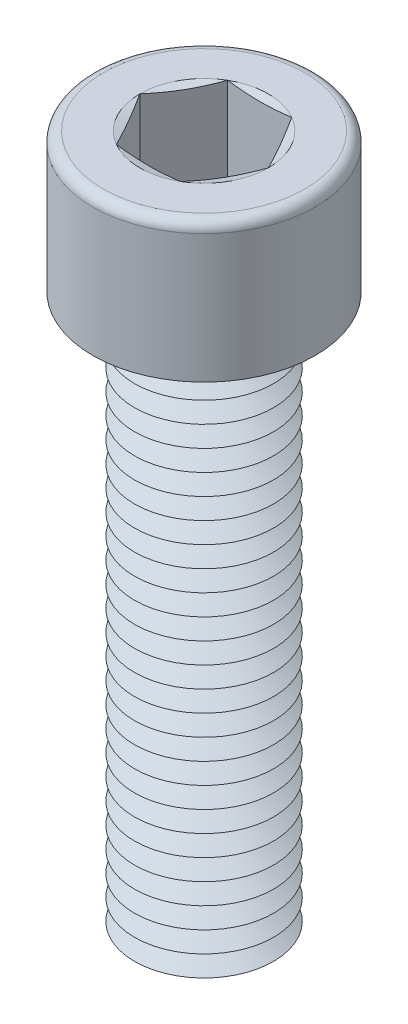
ISO-10303-21;
HEADER;
FILE_DESCRIPTION(('STEP AP214'),'2;1');
FILE_NAME('part.step','',(''),(''),'','','');
FILE_SCHEMA(('AUTOMOTIVE_DESIGN { 1 0 10303 214 1 1 1 1 }'));
ENDSEC;
DATA;
#1=APPLICATION_CONTEXT('core data for automotive mechanical design processes');
#2=APPLICATION_PROTOCOL_DEFINITION('international standard','automotive_design',2000,#1);
#3=PRODUCT_CONTEXT('',#1,'mechanical');
#4=PRODUCT('Part','Part','',(#3));
#5=PRODUCT_RELATED_PRODUCT_CATEGORY('part','',(#4));
#6=PRODUCT_DEFINITION_FORMATION('','',#4);
#7=PRODUCT_DEFINITION_CONTEXT('part definition',#1,'design');
#8=PRODUCT_DEFINITION('design','',#6,#7);
#9=PRODUCT_DEFINITION_SHAPE('','',#8);
#10=(LENGTH_UNIT() NAMED_UNIT(*) SI_UNIT(.MILLI.,.METRE.));
#11=(NAMED_UNIT(*) PLANE_ANGLE_UNIT() SI_UNIT($,.RADIAN.));
#12=(NAMED_UNIT(*) SI_UNIT($,.STERADIAN.) SOLID_ANGLE_UNIT());
#13=UNCERTAINTY_MEASURE_WITH_UNIT(LENGTH_MEASURE(1.E-05),#10,'distance_accuracy_value','');
#14=(GEOMETRIC_REPRESENTATION_CONTEXT(3) GLOBAL_UNCERTAINTY_ASSIGNED_CONTEXT((#13)) GLOBAL_UNIT_ASSIGNED_CONTEXT((#10,
#11,#12)) REPRESENTATION_CONTEXT('',''));
#15=CARTESIAN_POINT('',(0.,0.,0.));
#16=DIRECTION('',(0.,0.,1.));
#17=DIRECTION('',(1.,0.,0.));
#18=AXIS2_PLACEMENT_3D('',#15,#16,#17);
#19=CARTESIAN_POINT('',(0.,6.,0.));
#20=DIRECTION('',(0.,1.,0.));
#21=DIRECTION('',(0.,0.,1.));
#22=AXIS2_PLACEMENT_3D('',#19,#20,#21);
#23=CONICAL_SURFACE('',#22,3.70096189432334,1.0471975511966);
#24=CARTESIAN_POINT('',(0.,6.75,0.));
#25=DIRECTION('',(0.,1.,0.));
#26=DIRECTION('',(0.,0.,1.));
#27=AXIS2_PLACEMENT_3D('',#24,#25,#26);
#28=CIRCLE('',#27,5.);
#29=CARTESIAN_POINT('',(0.,6.75,5.));
#30=VERTEX_POINT('',#29);
#31=EDGE_CURVE('E526',#30,#30,#28,.T.);
#32=ORIENTED_EDGE('',*,*,#31,.F.);
#33=EDGE_LOOP('',(#32));
#34=FACE_BOUND('',#33,.T.);
#35=CARTESIAN_POINT('',(0.,6.,0.));
#36=DIRECTION('',(0.,1.,0.));
#37=DIRECTION('',(0.,0.,1.));
#38=AXIS2_PLACEMENT_3D('',#35,#36,#37);
#39=CIRCLE('',#38,3.70096189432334);
#40=CARTESIAN_POINT('',(0.,6.,3.70096189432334));
#41=VERTEX_POINT('',#40);
#42=EDGE_CURVE('E530',#41,#41,#39,.T.);
#43=ORIENTED_EDGE('',*,*,#42,.T.);
#44=EDGE_LOOP('',(#43));
#45=FACE_BOUND('',#44,.T.);
#46=ADVANCED_FACE('F41',(#34,#45),#23,.T.);
#47=CARTESIAN_POINT('',(0.,5.25,0.));
#48=DIRECTION('',(0.,-1.,0.));
#49=DIRECTION('',(0.,0.,-1.));
#50=AXIS2_PLACEMENT_3D('',#47,#48,#49);
#51=CONICAL_SURFACE('',#50,5.,1.0471975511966);
#52=ORIENTED_EDGE('',*,*,#42,.F.);
#53=EDGE_LOOP('',(#52));
#54=FACE_BOUND('',#53,.T.);
#55=CARTESIAN_POINT('',(0.,5.25,0.));
#56=DIRECTION('',(0.,1.,0.));
#57=DIRECTION('',(0.,0.,1.));
#58=AXIS2_PLACEMENT_3D('',#55,#56,#57);
#59=CIRCLE('',#58,5.);
#60=CARTESIAN_POINT('',(0.,5.25,5.));
#61=VERTEX_POINT('',#60);
#62=EDGE_CURVE('E534',#61,#61,#59,.T.);
#63=ORIENTED_EDGE('',*,*,#62,.T.);
#64=EDGE_LOOP('',(#63));
#65=FACE_BOUND('',#64,.T.);
#66=ADVANCED_FACE('F251',(#54,#65),#51,.T.);
#67=CARTESIAN_POINT('',(0.,0.,0.));
#68=DIRECTION('',(0.,1.,0.));
#69=DIRECTION('',(0.,0.,1.));
#70=AXIS2_PLACEMENT_3D('',#67,#68,#69);
#71=PLANE('',#70);
#72=CARTESIAN_POINT('',(0.,0.,0.));
#73=DIRECTION('',(0.,1.,0.));
#74=DIRECTION('',(0.,0.,1.));
#75=AXIS2_PLACEMENT_3D('',#72,#73,#74);
#76=CIRCLE('',#75,3.70096189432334);
#77=CARTESIAN_POINT('',(0.,0.,3.70096189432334));
#78=VERTEX_POINT('',#77);
#79=EDGE_CURVE('E562',#78,#78,#76,.T.);
#80=ORIENTED_EDGE('',*,*,#79,.F.);
#81=EDGE_LOOP('',(#80));
#82=FACE_BOUND('',#81,.T.);
#83=ADVANCED_FACE('F248',(#82),#71,.F.);
#84=CARTESIAN_POINT('',(0.,0.,0.));
#85=DIRECTION('',(0.,1.,0.));
#86=DIRECTION('',(0.,0.,1.));
#87=AXIS2_PLACEMENT_3D('',#84,#85,#86);
#88=CONICAL_SURFACE('',#87,3.70096189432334,1.0471975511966);
#89=CARTESIAN_POINT('',(0.,0.749999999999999,0.));
#90=DIRECTION('',(0.,1.,0.));
#91=DIRECTION('',(0.,0.,1.));
#92=AXIS2_PLACEMENT_3D('',#89,#90,#91);
#93=CIRCLE('',#92,5.);
#94=CARTESIAN_POINT('',(0.,0.749999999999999,5.));
#95=VERTEX_POINT('',#94);
#96=EDGE_CURVE('E558',#95,#95,#93,.T.);
#97=ORIENTED_EDGE('',*,*,#96,.F.);
#98=EDGE_LOOP('',(#97));
#99=FACE_BOUND('',#98,.T.);
#100=ORIENTED_EDGE('',*,*,#79,.T.);
#101=EDGE_LOOP('',(#100));
#102=FACE_BOUND('',#101,.T.);
#103=ADVANCED_FACE('F250',(#99,#102),#88,.T.);
#104=CARTESIAN_POINT('',(0.,0.749999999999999,0.));
#105=DIRECTION('',(0.,-1.,0.));
#106=DIRECTION('',(0.,0.,-1.));
#107=AXIS2_PLACEMENT_3D('',#104,#105,#106);
#108=CONICAL_SURFACE('',#107,5.,1.0471975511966);
#109=CARTESIAN_POINT('',(0.,1.5,0.));
#110=DIRECTION('',(0.,1.,0.));
#111=DIRECTION('',(0.,0.,1.));
#112=AXIS2_PLACEMENT_3D('',#109,#110,#111);
#113=CIRCLE('',#112,3.70096189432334);
#114=CARTESIAN_POINT('',(0.,1.5,3.70096189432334));
#115=VERTEX_POINT('',#114);
#116=EDGE_CURVE('E554',#115,#115,#113,.T.);
#117=ORIENTED_EDGE('',*,*,#116,.F.);
#118=EDGE_LOOP('',(#117));
#119=FACE_BOUND('',#118,.T.);
#120=ORIENTED_EDGE('',*,*,#96,.T.);
#121=EDGE_LOOP('',(#120));
#122=FACE_BOUND('',#121,.T.);
#123=ADVANCED_FACE('F291',(#119,#122),#108,.T.);
#124=CARTESIAN_POINT('',(0.,1.5,0.));
#125=DIRECTION('',(0.,1.,0.));
#126=DIRECTION('',(0.,0.,1.));
#127=AXIS2_PLACEMENT_3D('',#124,#125,#126);
#128=CONICAL_SURFACE('',#127,3.70096189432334,1.0471975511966);
#129=CARTESIAN_POINT('',(0.,2.25,0.));
#130=DIRECTION('',(0.,1.,0.));
#131=DIRECTION('',(0.,0.,1.));
#132=AXIS2_PLACEMENT_3D('',#129,#130,#131);
#133=CIRCLE('',#132,5.);
#134=CARTESIAN_POINT('',(0.,2.25,5.));
#135=VERTEX_POINT('',#134);
#136=EDGE_CURVE('E550',#135,#135,#133,.T.);
#137=ORIENTED_EDGE('',*,*,#136,.F.);
#138=EDGE_LOOP('',(#137));
#139=FACE_BOUND('',#138,.T.);
#140=ORIENTED_EDGE('',*,*,#116,.T.);
#141=EDGE_LOOP('',(#140));
#142=FACE_BOUND('',#141,.T.);
#143=ADVANCED_FACE('F286',(#139,#142),#128,.T.);
#144=CARTESIAN_POINT('',(0.,2.25,0.));
#145=DIRECTION('',(0.,-1.,0.));
#146=DIRECTION('',(0.,0.,-1.));
#147=AXIS2_PLACEMENT_3D('',#144,#145,#146);
#148=CONICAL_SURFACE('',#147,5.,1.0471975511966);
#149=CARTESIAN_POINT('',(0.,3.,0.));
#150=DIRECTION('',(0.,1.,0.));
#151=DIRECTION('',(0.,0.,1.));
#152=AXIS2_PLACEMENT_3D('',#149,#150,#151);
#153=CIRCLE('',#152,3.70096189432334);
#154=CARTESIAN_POINT('',(0.,3.,3.70096189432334));
#155=VERTEX_POINT('',#154);
#156=EDGE_CURVE('E546',#155,#155,#153,.T.);
#157=ORIENTED_EDGE('',*,*,#156,.F.);
#158=EDGE_LOOP('',(#157));
#159=FACE_BOUND('',#158,.T.);
#160=ORIENTED_EDGE('',*,*,#136,.T.);
#161=EDGE_LOOP('',(#160));
#162=FACE_BOUND('',#161,.T.);
#163=ADVANCED_FACE('F283',(#159,#162),#148,.T.);
#164=CARTESIAN_POINT('',(0.,3.,0.));
#165=DIRECTION('',(0.,1.,0.));
#166=DIRECTION('',(0.,0.,1.));
#167=AXIS2_PLACEMENT_3D('',#164,#165,#166);
#168=CONICAL_SURFACE('',#167,3.70096189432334,1.0471975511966);
#169=CARTESIAN_POINT('',(0.,3.75,0.));
#170=DIRECTION('',(0.,1.,0.));
#171=DIRECTION('',(0.,0.,1.));
#172=AXIS2_PLACEMENT_3D('',#169,#170,#171);
#173=CIRCLE('',#172,5.);
#174=CARTESIAN_POINT('',(0.,3.75,5.));
#175=VERTEX_POINT('',#174);
#176=EDGE_CURVE('E542',#175,#175,#173,.T.);
#177=ORIENTED_EDGE('',*,*,#176,.F.);
#178=EDGE_LOOP('',(#177));
#179=FACE_BOUND('',#178,.T.);
#180=ORIENTED_EDGE('',*,*,#156,.T.);
#181=EDGE_LOOP('',(#180));
#182=FACE_BOUND('',#181,.T.);
#183=ADVANCED_FACE('F277',(#179,#182),#168,.T.);
#184=CARTESIAN_POINT('',(0.,3.75,0.));
#185=DIRECTION('',(0.,-1.,0.));
#186=DIRECTION('',(0.,0.,-1.));
#187=AXIS2_PLACEMENT_3D('',#184,#185,#186);
#188=CONICAL_SURFACE('',#187,5.,1.0471975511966);
#189=CARTESIAN_POINT('',(0.,4.5,0.));
#190=DIRECTION('',(0.,1.,0.));
#191=DIRECTION('',(0.,0.,1.));
#192=AXIS2_PLACEMENT_3D('',#189,#190,#191);
#193=CIRCLE('',#192,3.70096189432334);
#194=CARTESIAN_POINT('',(0.,4.5,3.70096189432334));
#195=VERTEX_POINT('',#194);
#196=EDGE_CURVE('E538',#195,#195,#193,.T.);
#197=ORIENTED_EDGE('',*,*,#196,.F.);
#198=EDGE_LOOP('',(#197));
#199=FACE_BOUND('',#198,.T.);
#200=ORIENTED_EDGE('',*,*,#176,.T.);
#201=EDGE_LOOP('',(#200));
#202=FACE_BOUND('',#201,.T.);
#203=ADVANCED_FACE('F273',(#199,#202),#188,.T.);
#204=CARTESIAN_POINT('',(0.,4.5,0.));
#205=DIRECTION('',(0.,1.,0.));
#206=DIRECTION('',(0.,0.,1.));
#207=AXIS2_PLACEMENT_3D('',#204,#205,#206);
#208=CONICAL_SURFACE('',#207,3.70096189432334,1.0471975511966);
#209=ORIENTED_EDGE('',*,*,#62,.F.);
#210=EDGE_LOOP('',(#209));
#211=FACE_BOUND('',#210,.T.);
#212=ORIENTED_EDGE('',*,*,#196,.T.);
#213=EDGE_LOOP('',(#212));
#214=FACE_BOUND('',#213,.T.);
#215=ADVANCED_FACE('F276',(#211,#214),#208,.T.);
#216=CARTESIAN_POINT('',(0.,7.5,0.));
#217=DIRECTION('',(0.,1.,0.));
#218=DIRECTION('',(0.,0.,1.));
#219=AXIS2_PLACEMENT_3D('',#216,#217,#218);
#220=CONICAL_SURFACE('',#219,3.70096189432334,1.0471975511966);
#221=CARTESIAN_POINT('',(0.,8.25,0.));
#222=DIRECTION('',(0.,1.,0.));
#223=DIRECTION('',(0.,0.,1.));
#224=AXIS2_PLACEMENT_3D('',#221,#222,#223);
#225=CIRCLE('',#224,5.);
#226=CARTESIAN_POINT('',(0.,8.25,5.));
#227=VERTEX_POINT('',#226);
#228=EDGE_CURVE('E518',#227,#227,#225,.T.);
#229=ORIENTED_EDGE('',*,*,#228,.F.);
#230=EDGE_LOOP('',(#229));
#231=FACE_BOUND('',#230,.T.);
#232=CARTESIAN_POINT('',(0.,7.5,0.));
#233=DIRECTION('',(0.,1.,0.));
#234=DIRECTION('',(0.,0.,1.));
#235=AXIS2_PLACEMENT_3D('',#232,#233,#234);
#236=CIRCLE('',#235,3.70096189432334);
#237=CARTESIAN_POINT('',(0.,7.5,3.70096189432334));
#238=VERTEX_POINT('',#237);
#239=EDGE_CURVE('E522',#238,#238,#236,.T.);
#240=ORIENTED_EDGE('',*,*,#239,.T.);
#241=EDGE_LOOP('',(#240));
#242=FACE_BOUND('',#241,.T.);
#243=ADVANCED_FACE('F281',(#231,#242),#220,.T.);
#244=CARTESIAN_POINT('',(0.,6.75,0.));
#245=DIRECTION('',(0.,-1.,0.));
#246=DIRECTION('',(0.,0.,-1.));
#247=AXIS2_PLACEMENT_3D('',#244,#245,#246);
#248=CONICAL_SURFACE('',#247,5.,1.0471975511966);
#249=ORIENTED_EDGE('',*,*,#239,.F.);
#250=EDGE_LOOP('',(#249));
#251=FACE_BOUND('',#250,.T.);
#252=ORIENTED_EDGE('',*,*,#31,.T.);
#253=EDGE_LOOP('',(#252));
#254=FACE_BOUND('',#253,.T.);
#255=ADVANCED_FACE('F802',(#251,#254),#248,.T.);
#256=CARTESIAN_POINT('',(0.,9.,0.));
#257=DIRECTION('',(0.,1.,0.));
#258=DIRECTION('',(0.,0.,1.));
#259=AXIS2_PLACEMENT_3D('',#256,#257,#258);
#260=CONICAL_SURFACE('',#259,3.70096189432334,1.0471975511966);
#261=CARTESIAN_POINT('',(0.,9.75,0.));
#262=DIRECTION('',(0.,1.,0.));
#263=DIRECTION('',(0.,0.,1.));
#264=AXIS2_PLACEMENT_3D('',#261,#262,#263);
#265=CIRCLE('',#264,5.);
#266=CARTESIAN_POINT('',(0.,9.75,5.));
#267=VERTEX_POINT('',#266);
#268=EDGE_CURVE('E510',#267,#267,#265,.T.);
#269=ORIENTED_EDGE('',*,*,#268,.F.);
#270=EDGE_LOOP('',(#269));
#271=FACE_BOUND('',#270,.T.);
#272=CARTESIAN_POINT('',(0.,9.,0.));
#273=DIRECTION('',(0.,1.,0.));
#274=DIRECTION('',(0.,0.,1.));
#275=AXIS2_PLACEMENT_3D('',#272,#273,#274);
#276=CIRCLE('',#275,3.70096189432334);
#277=CARTESIAN_POINT('',(0.,9.,3.70096189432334));
#278=VERTEX_POINT('',#277);
#279=EDGE_CURVE('E514',#278,#278,#276,.T.);
#280=ORIENTED_EDGE('',*,*,#279,.T.);
#281=EDGE_LOOP('',(#280));
#282=FACE_BOUND('',#281,.T.);
#283=ADVANCED_FACE('F811',(#271,#282),#260,.T.);
#284=CARTESIAN_POINT('',(0.,8.25,0.));
#285=DIRECTION('',(0.,-1.,0.));
#286=DIRECTION('',(0.,0.,-1.));
#287=AXIS2_PLACEMENT_3D('',#284,#285,#286);
#288=CONICAL_SURFACE('',#287,5.,1.0471975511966);
#289=ORIENTED_EDGE('',*,*,#279,.F.);
#290=EDGE_LOOP('',(#289));
#291=FACE_BOUND('',#290,.T.);
#292=ORIENTED_EDGE('',*,*,#228,.T.);
#293=EDGE_LOOP('',(#292));
#294=FACE_BOUND('',#293,.T.);
#295=ADVANCED_FACE('F821',(#291,#294),#288,.T.);
#296=CARTESIAN_POINT('',(0.,10.5,0.));
#297=DIRECTION('',(0.,1.,0.));
#298=DIRECTION('',(0.,0.,1.));
#299=AXIS2_PLACEMENT_3D('',#296,#297,#298);
#300=CONICAL_SURFACE('',#299,3.70096189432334,1.0471975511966);
#301=CARTESIAN_POINT('',(0.,11.25,0.));
#302=DIRECTION('',(0.,1.,0.));
#303=DIRECTION('',(0.,0.,1.));
#304=AXIS2_PLACEMENT_3D('',#301,#302,#303);
#305=CIRCLE('',#304,5.);
#306=CARTESIAN_POINT('',(0.,11.25,5.));
#307=VERTEX_POINT('',#306);
#308=EDGE_CURVE('E502',#307,#307,#305,.T.);
#309=ORIENTED_EDGE('',*,*,#308,.F.);
#310=EDGE_LOOP('',(#309));
#311=FACE_BOUND('',#310,.T.);
#312=CARTESIAN_POINT('',(0.,10.5,0.));
#313=DIRECTION('',(0.,1.,0.));
#314=DIRECTION('',(0.,0.,1.));
#315=AXIS2_PLACEMENT_3D('',#312,#313,#314);
#316=CIRCLE('',#315,3.70096189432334);
#317=CARTESIAN_POINT('',(0.,10.5,3.70096189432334));
#318=VERTEX_POINT('',#317);
#319=EDGE_CURVE('E506',#318,#318,#316,.T.);
#320=ORIENTED_EDGE('',*,*,#319,.T.);
#321=EDGE_LOOP('',(#320));
#322=FACE_BOUND('',#321,.T.);
#323=ADVANCED_FACE('F831',(#311,#322),#300,.T.);
#324=CARTESIAN_POINT('',(0.,9.75,0.));
#325=DIRECTION('',(0.,-1.,0.));
#326=DIRECTION('',(0.,0.,-1.));
#327=AXIS2_PLACEMENT_3D('',#324,#325,#326);
#328=CONICAL_SURFACE('',#327,5.,1.0471975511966);
#329=ORIENTED_EDGE('',*,*,#319,.F.);
#330=EDGE_LOOP('',(#329));
#331=FACE_BOUND('',#330,.T.);
#332=ORIENTED_EDGE('',*,*,#268,.T.);
#333=EDGE_LOOP('',(#332));
#334=FACE_BOUND('',#333,.T.);
#335=ADVANCED_FACE('F841',(#331,#334),#328,.T.);
#336=CARTESIAN_POINT('',(0.,12.,0.));
#337=DIRECTION('',(0.,1.,0.));
#338=DIRECTION('',(0.,0.,1.));
#339=AXIS2_PLACEMENT_3D('',#336,#337,#338);
#340=CONICAL_SURFACE('',#339,3.70096189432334,1.0471975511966);
#341=CARTESIAN_POINT('',(0.,12.75,0.));
#342=DIRECTION('',(0.,1.,0.));
#343=DIRECTION('',(0.,0.,1.));
#344=AXIS2_PLACEMENT_3D('',#341,#342,#343);
#345=CIRCLE('',#344,5.);
#346=CARTESIAN_POINT('',(0.,12.75,5.));
#347=VERTEX_POINT('',#346);
#348=EDGE_CURVE('E494',#347,#347,#345,.T.);
#349=ORIENTED_EDGE('',*,*,#348,.F.);
#350=EDGE_LOOP('',(#349));
#351=FACE_BOUND('',#350,.T.);
#352=CARTESIAN_POINT('',(0.,12.,0.));
#353=DIRECTION('',(0.,1.,0.));
#354=DIRECTION('',(0.,0.,1.));
#355=AXIS2_PLACEMENT_3D('',#352,#353,#354);
#356=CIRCLE('',#355,3.70096189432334);
#357=CARTESIAN_POINT('',(0.,12.,3.70096189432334));
#358=VERTEX_POINT('',#357);
#359=EDGE_CURVE('E498',#358,#358,#356,.T.);
#360=ORIENTED_EDGE('',*,*,#359,.T.);
#361=EDGE_LOOP('',(#360));
#362=FACE_BOUND('',#361,.T.);
#363=ADVANCED_FACE('F851',(#351,#362),#340,.T.);
#364=CARTESIAN_POINT('',(0.,11.25,0.));
#365=DIRECTION('',(0.,-1.,0.));
#366=DIRECTION('',(0.,0.,-1.));
#367=AXIS2_PLACEMENT_3D('',#364,#365,#366);
#368=CONICAL_SURFACE('',#367,5.,1.0471975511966);
#369=ORIENTED_EDGE('',*,*,#359,.F.);
#370=EDGE_LOOP('',(#369));
#371=FACE_BOUND('',#370,.T.);
#372=ORIENTED_EDGE('',*,*,#308,.T.);
#373=EDGE_LOOP('',(#372));
#374=FACE_BOUND('',#373,.T.);
#375=ADVANCED_FACE('F861',(#371,#374),#368,.T.);
#376=CARTESIAN_POINT('',(0.,13.5,0.));
#377=DIRECTION('',(0.,1.,0.));
#378=DIRECTION('',(0.,0.,1.));
#379=AXIS2_PLACEMENT_3D('',#376,#377,#378);
#380=CONICAL_SURFACE('',#379,3.70096189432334,1.0471975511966);
#381=CARTESIAN_POINT('',(0.,14.25,0.));
#382=DIRECTION('',(0.,1.,0.));
#383=DIRECTION('',(0.,0.,1.));
#384=AXIS2_PLACEMENT_3D('',#381,#382,#383);
#385=CIRCLE('',#384,5.);
#386=CARTESIAN_POINT('',(0.,14.25,5.));
#387=VERTEX_POINT('',#386);
#388=EDGE_CURVE('E486',#387,#387,#385,.T.);
#389=ORIENTED_EDGE('',*,*,#388,.F.);
#390=EDGE_LOOP('',(#389));
#391=FACE_BOUND('',#390,.T.);
#392=CARTESIAN_POINT('',(0.,13.5,0.));
#393=DIRECTION('',(0.,1.,0.));
#394=DIRECTION('',(0.,0.,1.));
#395=AXIS2_PLACEMENT_3D('',#392,#393,#394);
#396=CIRCLE('',#395,3.70096189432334);
#397=CARTESIAN_POINT('',(0.,13.5,3.70096189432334));
#398=VERTEX_POINT('',#397);
#399=EDGE_CURVE('E490',#398,#398,#396,.T.);
#400=ORIENTED_EDGE('',*,*,#399,.T.);
#401=EDGE_LOOP('',(#400));
#402=FACE_BOUND('',#401,.T.);
#403=ADVANCED_FACE('F871',(#391,#402),#380,.T.);
#404=CARTESIAN_POINT('',(0.,12.75,0.));
#405=DIRECTION('',(0.,-1.,0.));
#406=DIRECTION('',(0.,0.,-1.));
#407=AXIS2_PLACEMENT_3D('',#404,#405,#406);
#408=CONICAL_SURFACE('',#407,5.,1.0471975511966);
#409=ORIENTED_EDGE('',*,*,#399,.F.);
#410=EDGE_LOOP('',(#409));
#411=FACE_BOUND('',#410,.T.);
#412=ORIENTED_EDGE('',*,*,#348,.T.);
#413=EDGE_LOOP('',(#412));
#414=FACE_BOUND('',#413,.T.);
#415=ADVANCED_FACE('F881',(#411,#414),#408,.T.);
#416=CARTESIAN_POINT('',(0.,15.,0.));
#417=DIRECTION('',(0.,1.,0.));
#418=DIRECTION('',(0.,0.,1.));
#419=AXIS2_PLACEMENT_3D('',#416,#417,#418);
#420=CONICAL_SURFACE('',#419,3.70096189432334,1.0471975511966);
#421=CARTESIAN_POINT('',(0.,15.75,0.));
#422=DIRECTION('',(0.,1.,0.));
#423=DIRECTION('',(0.,0.,1.));
#424=AXIS2_PLACEMENT_3D('',#421,#422,#423);
#425=CIRCLE('',#424,5.);
#426=CARTESIAN_POINT('',(0.,15.75,5.));
#427=VERTEX_POINT('',#426);
#428=EDGE_CURVE('E478',#427,#427,#425,.T.);
#429=ORIENTED_EDGE('',*,*,#428,.F.);
#430=EDGE_LOOP('',(#429));
#431=FACE_BOUND('',#430,.T.);
#432=CARTESIAN_POINT('',(0.,15.,0.));
#433=DIRECTION('',(0.,1.,0.));
#434=DIRECTION('',(0.,0.,1.));
#435=AXIS2_PLACEMENT_3D('',#432,#433,#434);
#436=CIRCLE('',#435,3.70096189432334);
#437=CARTESIAN_POINT('',(0.,15.,3.70096189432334));
#438=VERTEX_POINT('',#437);
#439=EDGE_CURVE('E482',#438,#438,#436,.T.);
#440=ORIENTED_EDGE('',*,*,#439,.T.);
#441=EDGE_LOOP('',(#440));
#442=FACE_BOUND('',#441,.T.);
#443=ADVANCED_FACE('F891',(#431,#442),#420,.T.);
#444=CARTESIAN_POINT('',(0.,14.25,0.));
#445=DIRECTION('',(0.,-1.,0.));
#446=DIRECTION('',(0.,0.,-1.));
#447=AXIS2_PLACEMENT_3D('',#444,#445,#446);
#448=CONICAL_SURFACE('',#447,5.,1.0471975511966);
#449=ORIENTED_EDGE('',*,*,#439,.F.);
#450=EDGE_LOOP('',(#449));
#451=FACE_BOUND('',#450,.T.);
#452=ORIENTED_EDGE('',*,*,#388,.T.);
#453=EDGE_LOOP('',(#452));
#454=FACE_BOUND('',#453,.T.);
#455=ADVANCED_FACE('F901',(#451,#454),#448,.T.);
#456=CARTESIAN_POINT('',(0.,16.5,0.));
#457=DIRECTION('',(0.,1.,0.));
#458=DIRECTION('',(0.,0.,1.));
#459=AXIS2_PLACEMENT_3D('',#456,#457,#458);
#460=CONICAL_SURFACE('',#459,3.70096189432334,1.0471975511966);
#461=CARTESIAN_POINT('',(0.,17.25,0.));
#462=DIRECTION('',(0.,1.,0.));
#463=DIRECTION('',(0.,0.,1.));
#464=AXIS2_PLACEMENT_3D('',#461,#462,#463);
#465=CIRCLE('',#464,5.);
#466=CARTESIAN_POINT('',(0.,17.25,5.));
#467=VERTEX_POINT('',#466);
#468=EDGE_CURVE('E470',#467,#467,#465,.T.);
#469=ORIENTED_EDGE('',*,*,#468,.F.);
#470=EDGE_LOOP('',(#469));
#471=FACE_BOUND('',#470,.T.);
#472=CARTESIAN_POINT('',(0.,16.5,0.));
#473=DIRECTION('',(0.,1.,0.));
#474=DIRECTION('',(0.,0.,1.));
#475=AXIS2_PLACEMENT_3D('',#472,#473,#474);
#476=CIRCLE('',#475,3.70096189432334);
#477=CARTESIAN_POINT('',(0.,16.5,3.70096189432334));
#478=VERTEX_POINT('',#477);
#479=EDGE_CURVE('E474',#478,#478,#476,.T.);
#480=ORIENTED_EDGE('',*,*,#479,.T.);
#481=EDGE_LOOP('',(#480));
#482=FACE_BOUND('',#481,.T.);
#483=ADVANCED_FACE('F911',(#471,#482),#460,.T.);
#484=CARTESIAN_POINT('',(0.,15.75,0.));
#485=DIRECTION('',(0.,-1.,0.));
#486=DIRECTION('',(0.,0.,-1.));
#487=AXIS2_PLACEMENT_3D('',#484,#485,#486);
#488=CONICAL_SURFACE('',#487,5.,1.0471975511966);
#489=ORIENTED_EDGE('',*,*,#479,.F.);
#490=EDGE_LOOP('',(#489));
#491=FACE_BOUND('',#490,.T.);
#492=ORIENTED_EDGE('',*,*,#428,.T.);
#493=EDGE_LOOP('',(#492));
#494=FACE_BOUND('',#493,.T.);
#495=ADVANCED_FACE('F921',(#491,#494),#488,.T.);
#496=CARTESIAN_POINT('',(0.,18.,0.));
#497=DIRECTION('',(0.,1.,0.));
#498=DIRECTION('',(0.,0.,1.));
#499=AXIS2_PLACEMENT_3D('',#496,#497,#498);
#500=CONICAL_SURFACE('',#499,3.70096189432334,1.0471975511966);
#501=CARTESIAN_POINT('',(0.,18.75,0.));
#502=DIRECTION('',(0.,1.,0.));
#503=DIRECTION('',(0.,0.,1.));
#504=AXIS2_PLACEMENT_3D('',#501,#502,#503);
#505=CIRCLE('',#504,5.);
#506=CARTESIAN_POINT('',(0.,18.75,5.));
#507=VERTEX_POINT('',#506);
#508=EDGE_CURVE('E462',#507,#507,#505,.T.);
#509=ORIENTED_EDGE('',*,*,#508,.F.);
#510=EDGE_LOOP('',(#509));
#511=FACE_BOUND('',#510,.T.);
#512=CARTESIAN_POINT('',(0.,18.,0.));
#513=DIRECTION('',(0.,1.,0.));
#514=DIRECTION('',(0.,0.,1.));
#515=AXIS2_PLACEMENT_3D('',#512,#513,#514);
#516=CIRCLE('',#515,3.70096189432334);
#517=CARTESIAN_POINT('',(0.,18.,3.70096189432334));
#518=VERTEX_POINT('',#517);
#519=EDGE_CURVE('E466',#518,#518,#516,.T.);
#520=ORIENTED_EDGE('',*,*,#519,.T.);
#521=EDGE_LOOP('',(#520));
#522=FACE_BOUND('',#521,.T.);
#523=ADVANCED_FACE('F931',(#511,#522),#500,.T.);
#524=CARTESIAN_POINT('',(0.,17.25,0.));
#525=DIRECTION('',(0.,-1.,0.));
#526=DIRECTION('',(0.,0.,-1.));
#527=AXIS2_PLACEMENT_3D('',#524,#525,#526);
#528=CONICAL_SURFACE('',#527,5.,1.0471975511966);
#529=ORIENTED_EDGE('',*,*,#519,.F.);
#530=EDGE_LOOP('',(#529));
#531=FACE_BOUND('',#530,.T.);
#532=ORIENTED_EDGE('',*,*,#468,.T.);
#533=EDGE_LOOP('',(#532));
#534=FACE_BOUND('',#533,.T.);
#535=ADVANCED_FACE('F941',(#531,#534),#528,.T.);
#536=CARTESIAN_POINT('',(0.,19.5,0.));
#537=DIRECTION('',(0.,1.,0.));
#538=DIRECTION('',(0.,0.,1.));
#539=AXIS2_PLACEMENT_3D('',#536,#537,#538);
#540=CONICAL_SURFACE('',#539,3.70096189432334,1.0471975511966);
#541=CARTESIAN_POINT('',(0.,20.25,0.));
#542=DIRECTION('',(0.,1.,0.));
#543=DIRECTION('',(0.,0.,1.));
#544=AXIS2_PLACEMENT_3D('',#541,#542,#543);
#545=CIRCLE('',#544,5.);
#546=CARTESIAN_POINT('',(0.,20.25,5.));
#547=VERTEX_POINT('',#546);
#548=EDGE_CURVE('E454',#547,#547,#545,.T.);
#549=ORIENTED_EDGE('',*,*,#548,.F.);
#550=EDGE_LOOP('',(#549));
#551=FACE_BOUND('',#550,.T.);
#552=CARTESIAN_POINT('',(0.,19.5,0.));
#553=DIRECTION('',(0.,1.,0.));
#554=DIRECTION('',(0.,0.,1.));
#555=AXIS2_PLACEMENT_3D('',#552,#553,#554);
#556=CIRCLE('',#555,3.70096189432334);
#557=CARTESIAN_POINT('',(0.,19.5,3.70096189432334));
#558=VERTEX_POINT('',#557);
#559=EDGE_CURVE('E458',#558,#558,#556,.T.);
#560=ORIENTED_EDGE('',*,*,#559,.T.);
#561=EDGE_LOOP('',(#560));
#562=FACE_BOUND('',#561,.T.);
#563=ADVANCED_FACE('F951',(#551,#562),#540,.T.);
#564=CARTESIAN_POINT('',(0.,18.75,0.));
#565=DIRECTION('',(0.,-1.,0.));
#566=DIRECTION('',(0.,0.,-1.));
#567=AXIS2_PLACEMENT_3D('',#564,#565,#566);
#568=CONICAL_SURFACE('',#567,5.,1.0471975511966);
#569=ORIENTED_EDGE('',*,*,#559,.F.);
#570=EDGE_LOOP('',(#569));
#571=FACE_BOUND('',#570,.T.);
#572=ORIENTED_EDGE('',*,*,#508,.T.);
#573=EDGE_LOOP('',(#572));
#574=FACE_BOUND('',#573,.T.);
#575=ADVANCED_FACE('F961',(#571,#574),#568,.T.);
#576=CARTESIAN_POINT('',(0.,21.,0.));
#577=DIRECTION('',(0.,1.,0.));
#578=DIRECTION('',(0.,0.,1.));
#579=AXIS2_PLACEMENT_3D('',#576,#577,#578);
#580=CONICAL_SURFACE('',#579,3.70096189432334,1.0471975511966);
#581=CARTESIAN_POINT('',(0.,21.75,0.));
#582=DIRECTION('',(0.,1.,0.));
#583=DIRECTION('',(0.,0.,1.));
#584=AXIS2_PLACEMENT_3D('',#581,#582,#583);
#585=CIRCLE('',#584,5.);
#586=CARTESIAN_POINT('',(0.,21.75,5.));
#587=VERTEX_POINT('',#586);
#588=EDGE_CURVE('E446',#587,#587,#585,.T.);
#589=ORIENTED_EDGE('',*,*,#588,.F.);
#590=EDGE_LOOP('',(#589));
#591=FACE_BOUND('',#590,.T.);
#592=CARTESIAN_POINT('',(0.,21.,0.));
#593=DIRECTION('',(0.,1.,0.));
#594=DIRECTION('',(0.,0.,1.));
#595=AXIS2_PLACEMENT_3D('',#592,#593,#594);
#596=CIRCLE('',#595,3.70096189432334);
#597=CARTESIAN_POINT('',(0.,21.,3.70096189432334));
#598=VERTEX_POINT('',#597);
#599=EDGE_CURVE('E450',#598,#598,#596,.T.);
#600=ORIENTED_EDGE('',*,*,#599,.T.);
#601=EDGE_LOOP('',(#600));
#602=FACE_BOUND('',#601,.T.);
#603=ADVANCED_FACE('F971',(#591,#602),#580,.T.);
#604=CARTESIAN_POINT('',(0.,20.25,0.));
#605=DIRECTION('',(0.,-1.,0.));
#606=DIRECTION('',(0.,0.,-1.));
#607=AXIS2_PLACEMENT_3D('',#604,#605,#606);
#608=CONICAL_SURFACE('',#607,5.,1.0471975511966);
#609=ORIENTED_EDGE('',*,*,#599,.F.);
#610=EDGE_LOOP('',(#609));
#611=FACE_BOUND('',#610,.T.);
#612=ORIENTED_EDGE('',*,*,#548,.T.);
#613=EDGE_LOOP('',(#612));
#614=FACE_BOUND('',#613,.T.);
#615=ADVANCED_FACE('F981',(#611,#614),#608,.T.);
#616=CARTESIAN_POINT('',(0.,22.5,0.));
#617=DIRECTION('',(0.,1.,0.));
#618=DIRECTION('',(0.,0.,1.));
#619=AXIS2_PLACEMENT_3D('',#616,#617,#618);
#620=CONICAL_SURFACE('',#619,3.70096189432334,1.0471975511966);
#621=CARTESIAN_POINT('',(0.,23.25,0.));
#622=DIRECTION('',(0.,1.,0.));
#623=DIRECTION('',(0.,0.,1.));
#624=AXIS2_PLACEMENT_3D('',#621,#622,#623);
#625=CIRCLE('',#624,5.);
#626=CARTESIAN_POINT('',(0.,23.25,5.));
#627=VERTEX_POINT('',#626);
#628=EDGE_CURVE('E438',#627,#627,#625,.T.);
#629=ORIENTED_EDGE('',*,*,#628,.F.);
#630=EDGE_LOOP('',(#629));
#631=FACE_BOUND('',#630,.T.);
#632=CARTESIAN_POINT('',(0.,22.5,0.));
#633=DIRECTION('',(0.,1.,0.));
#634=DIRECTION('',(0.,0.,1.));
#635=AXIS2_PLACEMENT_3D('',#632,#633,#634);
#636=CIRCLE('',#635,3.70096189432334);
#637=CARTESIAN_POINT('',(0.,22.5,3.70096189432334));
#638=VERTEX_POINT('',#637);
#639=EDGE_CURVE('E442',#638,#638,#636,.T.);
#640=ORIENTED_EDGE('',*,*,#639,.T.);
#641=EDGE_LOOP('',(#640));
#642=FACE_BOUND('',#641,.T.);
#643=ADVANCED_FACE('F991',(#631,#642),#620,.T.);
#644=CARTESIAN_POINT('',(0.,21.75,0.));
#645=DIRECTION('',(0.,-1.,0.));
#646=DIRECTION('',(0.,0.,-1.));
#647=AXIS2_PLACEMENT_3D('',#644,#645,#646);
#648=CONICAL_SURFACE('',#647,5.,1.0471975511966);
#649=ORIENTED_EDGE('',*,*,#639,.F.);
#650=EDGE_LOOP('',(#649));
#651=FACE_BOUND('',#650,.T.);
#652=ORIENTED_EDGE('',*,*,#588,.T.);
#653=EDGE_LOOP('',(#652));
#654=FACE_BOUND('',#653,.T.);
#655=ADVANCED_FACE('F1001',(#651,#654),#648,.T.);
#656=CARTESIAN_POINT('',(0.,24.,0.));
#657=DIRECTION('',(0.,1.,0.));
#658=DIRECTION('',(0.,0.,1.));
#659=AXIS2_PLACEMENT_3D('',#656,#657,#658);
#660=CONICAL_SURFACE('',#659,3.70096189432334,1.0471975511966);
#661=CARTESIAN_POINT('',(0.,24.75,0.));
#662=DIRECTION('',(0.,1.,0.));
#663=DIRECTION('',(0.,0.,1.));
#664=AXIS2_PLACEMENT_3D('',#661,#662,#663);
#665=CIRCLE('',#664,5.);
#666=CARTESIAN_POINT('',(0.,24.75,5.));
#667=VERTEX_POINT('',#666);
#668=EDGE_CURVE('E430',#667,#667,#665,.T.);
#669=ORIENTED_EDGE('',*,*,#668,.F.);
#670=EDGE_LOOP('',(#669));
#671=FACE_BOUND('',#670,.T.);
#672=CARTESIAN_POINT('',(0.,24.,0.));
#673=DIRECTION('',(0.,1.,0.));
#674=DIRECTION('',(0.,0.,1.));
#675=AXIS2_PLACEMENT_3D('',#672,#673,#674);
#676=CIRCLE('',#675,3.70096189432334);
#677=CARTESIAN_POINT('',(0.,24.,3.70096189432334));
#678=VERTEX_POINT('',#677);
#679=EDGE_CURVE('E434',#678,#678,#676,.T.);
#680=ORIENTED_EDGE('',*,*,#679,.T.);
#681=EDGE_LOOP('',(#680));
#682=FACE_BOUND('',#681,.T.);
#683=ADVANCED_FACE('F1011',(#671,#682),#660,.T.);
#684=CARTESIAN_POINT('',(0.,23.25,0.));
#685=DIRECTION('',(0.,-1.,0.));
#686=DIRECTION('',(0.,0.,-1.));
#687=AXIS2_PLACEMENT_3D('',#684,#685,#686);
#688=CONICAL_SURFACE('',#687,5.,1.0471975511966);
#689=ORIENTED_EDGE('',*,*,#679,.F.);
#690=EDGE_LOOP('',(#689));
#691=FACE_BOUND('',#690,.T.);
#692=ORIENTED_EDGE('',*,*,#628,.T.);
#693=EDGE_LOOP('',(#692));
#694=FACE_BOUND('',#693,.T.);
#695=ADVANCED_FACE('F1021',(#691,#694),#688,.T.);
#696=CARTESIAN_POINT('',(0.,25.5,0.));
#697=DIRECTION('',(0.,1.,0.));
#698=DIRECTION('',(0.,0.,1.));
#699=AXIS2_PLACEMENT_3D('',#696,#697,#698);
#700=CONICAL_SURFACE('',#699,3.70096189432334,1.0471975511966);
#701=CARTESIAN_POINT('',(0.,26.25,0.));
#702=DIRECTION('',(0.,1.,0.));
#703=DIRECTION('',(0.,0.,1.));
#704=AXIS2_PLACEMENT_3D('',#701,#702,#703);
#705=CIRCLE('',#704,5.);
#706=CARTESIAN_POINT('',(0.,26.25,5.));
#707=VERTEX_POINT('',#706);
#708=EDGE_CURVE('E422',#707,#707,#705,.T.);
#709=ORIENTED_EDGE('',*,*,#708,.F.);
#710=EDGE_LOOP('',(#709));
#711=FACE_BOUND('',#710,.T.);
#712=CARTESIAN_POINT('',(0.,25.5,0.));
#713=DIRECTION('',(0.,1.,0.));
#714=DIRECTION('',(0.,0.,1.));
#715=AXIS2_PLACEMENT_3D('',#712,#713,#714);
#716=CIRCLE('',#715,3.70096189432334);
#717=CARTESIAN_POINT('',(0.,25.5,3.70096189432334));
#718=VERTEX_POINT('',#717);
#719=EDGE_CURVE('E426',#718,#718,#716,.T.);
#720=ORIENTED_EDGE('',*,*,#719,.T.);
#721=EDGE_LOOP('',(#720));
#722=FACE_BOUND('',#721,.T.);
#723=ADVANCED_FACE('F1031',(#711,#722),#700,.T.);
#724=CARTESIAN_POINT('',(0.,24.75,0.));
#725=DIRECTION('',(0.,-1.,0.));
#726=DIRECTION('',(0.,0.,-1.));
#727=AXIS2_PLACEMENT_3D('',#724,#725,#726);
#728=CONICAL_SURFACE('',#727,5.,1.0471975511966);
#729=ORIENTED_EDGE('',*,*,#719,.F.);
#730=EDGE_LOOP('',(#729));
#731=FACE_BOUND('',#730,.T.);
#732=ORIENTED_EDGE('',*,*,#668,.T.);
#733=EDGE_LOOP('',(#732));
#734=FACE_BOUND('',#733,.T.);
#735=ADVANCED_FACE('F1041',(#731,#734),#728,.T.);
#736=CARTESIAN_POINT('',(0.,27.,0.));
#737=DIRECTION('',(0.,1.,0.));
#738=DIRECTION('',(0.,0.,1.));
#739=AXIS2_PLACEMENT_3D('',#736,#737,#738);
#740=CONICAL_SURFACE('',#739,3.70096189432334,1.0471975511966);
#741=CARTESIAN_POINT('',(0.,27.75,0.));
#742=DIRECTION('',(0.,1.,0.));
#743=DIRECTION('',(0.,0.,1.));
#744=AXIS2_PLACEMENT_3D('',#741,#742,#743);
#745=CIRCLE('',#744,5.);
#746=CARTESIAN_POINT('',(0.,27.75,5.));
#747=VERTEX_POINT('',#746);
#748=EDGE_CURVE('E414',#747,#747,#745,.T.);
#749=ORIENTED_EDGE('',*,*,#748,.F.);
#750=EDGE_LOOP('',(#749));
#751=FACE_BOUND('',#750,.T.);
#752=CARTESIAN_POINT('',(0.,27.,0.));
#753=DIRECTION('',(0.,1.,0.));
#754=DIRECTION('',(0.,0.,1.));
#755=AXIS2_PLACEMENT_3D('',#752,#753,#754);
#756=CIRCLE('',#755,3.70096189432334);
#757=CARTESIAN_POINT('',(0.,27.,3.70096189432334));
#758=VERTEX_POINT('',#757);
#759=EDGE_CURVE('E418',#758,#758,#756,.T.);
#760=ORIENTED_EDGE('',*,*,#759,.T.);
#761=EDGE_LOOP('',(#760));
#762=FACE_BOUND('',#761,.T.);
#763=ADVANCED_FACE('F1051',(#751,#762),#740,.T.);
#764=CARTESIAN_POINT('',(0.,26.25,0.));
#765=DIRECTION('',(0.,-1.,0.));
#766=DIRECTION('',(0.,0.,-1.));
#767=AXIS2_PLACEMENT_3D('',#764,#765,#766);
#768=CONICAL_SURFACE('',#767,5.,1.0471975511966);
#769=ORIENTED_EDGE('',*,*,#759,.F.);
#770=EDGE_LOOP('',(#769));
#771=FACE_BOUND('',#770,.T.);
#772=ORIENTED_EDGE('',*,*,#708,.T.);
#773=EDGE_LOOP('',(#772));
#774=FACE_BOUND('',#773,.T.);
#775=ADVANCED_FACE('F1061',(#771,#774),#768,.T.);
#776=CARTESIAN_POINT('',(0.,28.5,0.));
#777=DIRECTION('',(0.,1.,0.));
#778=DIRECTION('',(0.,0.,1.));
#779=AXIS2_PLACEMENT_3D('',#776,#777,#778);
#780=CONICAL_SURFACE('',#779,3.70096189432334,1.0471975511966);
#781=CARTESIAN_POINT('',(0.,29.25,0.));
#782=DIRECTION('',(0.,1.,0.));
#783=DIRECTION('',(0.,0.,1.));
#784=AXIS2_PLACEMENT_3D('',#781,#782,#783);
#785=CIRCLE('',#784,5.);
#786=CARTESIAN_POINT('',(0.,29.25,5.));
#787=VERTEX_POINT('',#786);
#788=EDGE_CURVE('E406',#787,#787,#785,.T.);
#789=ORIENTED_EDGE('',*,*,#788,.F.);
#790=EDGE_LOOP('',(#789));
#791=FACE_BOUND('',#790,.T.);
#792=CARTESIAN_POINT('',(0.,28.5,0.));
#793=DIRECTION('',(0.,1.,0.));
#794=DIRECTION('',(0.,0.,1.));
#795=AXIS2_PLACEMENT_3D('',#792,#793,#794);
#796=CIRCLE('',#795,3.70096189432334);
#797=CARTESIAN_POINT('',(0.,28.5,3.70096189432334));
#798=VERTEX_POINT('',#797);
#799=EDGE_CURVE('E410',#798,#798,#796,.T.);
#800=ORIENTED_EDGE('',*,*,#799,.T.);
#801=EDGE_LOOP('',(#800));
#802=FACE_BOUND('',#801,.T.);
#803=ADVANCED_FACE('F1071',(#791,#802),#780,.T.);
#804=CARTESIAN_POINT('',(0.,27.75,0.));
#805=DIRECTION('',(0.,-1.,0.));
#806=DIRECTION('',(0.,0.,-1.));
#807=AXIS2_PLACEMENT_3D('',#804,#805,#806);
#808=CONICAL_SURFACE('',#807,5.,1.0471975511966);
#809=ORIENTED_EDGE('',*,*,#799,.F.);
#810=EDGE_LOOP('',(#809));
#811=FACE_BOUND('',#810,.T.);
#812=ORIENTED_EDGE('',*,*,#748,.T.);
#813=EDGE_LOOP('',(#812));
#814=FACE_BOUND('',#813,.T.);
#815=ADVANCED_FACE('F1081',(#811,#814),#808,.T.);
#816=CARTESIAN_POINT('',(0.,30.,0.));
#817=DIRECTION('',(0.,1.,0.));
#818=DIRECTION('',(0.,0.,1.));
#819=AXIS2_PLACEMENT_3D('',#816,#817,#818);
#820=CONICAL_SURFACE('',#819,3.70096189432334,1.0471975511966);
#821=CARTESIAN_POINT('',(0.,30.75,0.));
#822=DIRECTION('',(0.,1.,0.));
#823=DIRECTION('',(0.,0.,1.));
#824=AXIS2_PLACEMENT_3D('',#821,#822,#823);
#825=CIRCLE('',#824,5.);
#826=CARTESIAN_POINT('',(0.,30.75,5.));
#827=VERTEX_POINT('',#826);
#828=EDGE_CURVE('E398',#827,#827,#825,.T.);
#829=ORIENTED_EDGE('',*,*,#828,.F.);
#830=EDGE_LOOP('',(#829));
#831=FACE_BOUND('',#830,.T.);
#832=CARTESIAN_POINT('',(0.,30.,0.));
#833=DIRECTION('',(0.,1.,0.));
#834=DIRECTION('',(0.,0.,1.));
#835=AXIS2_PLACEMENT_3D('',#832,#833,#834);
#836=CIRCLE('',#835,3.70096189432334);
#837=CARTESIAN_POINT('',(0.,30.,3.70096189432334));
#838=VERTEX_POINT('',#837);
#839=EDGE_CURVE('E402',#838,#838,#836,.T.);
#840=ORIENTED_EDGE('',*,*,#839,.T.);
#841=EDGE_LOOP('',(#840));
#842=FACE_BOUND('',#841,.T.);
#843=ADVANCED_FACE('F1091',(#831,#842),#820,.T.);
#844=CARTESIAN_POINT('',(0.,29.25,0.));
#845=DIRECTION('',(0.,-1.,0.));
#846=DIRECTION('',(0.,0.,-1.));
#847=AXIS2_PLACEMENT_3D('',#844,#845,#846);
#848=CONICAL_SURFACE('',#847,5.,1.0471975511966);
#849=ORIENTED_EDGE('',*,*,#839,.F.);
#850=EDGE_LOOP('',(#849));
#851=FACE_BOUND('',#850,.T.);
#852=ORIENTED_EDGE('',*,*,#788,.T.);
#853=EDGE_LOOP('',(#852));
#854=FACE_BOUND('',#853,.T.);
#855=ADVANCED_FACE('F1101',(#851,#854),#848,.T.);
#856=CARTESIAN_POINT('',(0.,31.5,0.));
#857=DIRECTION('',(0.,1.,0.));
#858=DIRECTION('',(0.,0.,1.));
#859=AXIS2_PLACEMENT_3D('',#856,#857,#858);
#860=CONICAL_SURFACE('',#859,3.70096189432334,1.0471975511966);
#861=CARTESIAN_POINT('',(0.,32.25,0.));
#862=DIRECTION('',(0.,1.,0.));
#863=DIRECTION('',(0.,0.,1.));
#864=AXIS2_PLACEMENT_3D('',#861,#862,#863);
#865=CIRCLE('',#864,5.);
#866=CARTESIAN_POINT('',(0.,32.25,5.));
#867=VERTEX_POINT('',#866);
#868=EDGE_CURVE('E390',#867,#867,#865,.T.);
#869=ORIENTED_EDGE('',*,*,#868,.F.);
#870=EDGE_LOOP('',(#869));
#871=FACE_BOUND('',#870,.T.);
#872=CARTESIAN_POINT('',(0.,31.5,0.));
#873=DIRECTION('',(0.,1.,0.));
#874=DIRECTION('',(0.,0.,1.));
#875=AXIS2_PLACEMENT_3D('',#872,#873,#874);
#876=CIRCLE('',#875,3.70096189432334);
#877=CARTESIAN_POINT('',(0.,31.5,3.70096189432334));
#878=VERTEX_POINT('',#877);
#879=EDGE_CURVE('E394',#878,#878,#876,.T.);
#880=ORIENTED_EDGE('',*,*,#879,.T.);
#881=EDGE_LOOP('',(#880));
#882=FACE_BOUND('',#881,.T.);
#883=ADVANCED_FACE('F1111',(#871,#882),#860,.T.);
#884=CARTESIAN_POINT('',(0.,30.75,0.));
#885=DIRECTION('',(0.,-1.,0.));
#886=DIRECTION('',(0.,0.,-1.));
#887=AXIS2_PLACEMENT_3D('',#884,#885,#886);
#888=CONICAL_SURFACE('',#887,5.,1.0471975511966);
#889=ORIENTED_EDGE('',*,*,#879,.F.);
#890=EDGE_LOOP('',(#889));
#891=FACE_BOUND('',#890,.T.);
#892=ORIENTED_EDGE('',*,*,#828,.T.);
#893=EDGE_LOOP('',(#892));
#894=FACE_BOUND('',#893,.T.);
#895=ADVANCED_FACE('F1121',(#891,#894),#888,.T.);
#896=CARTESIAN_POINT('',(0.,33.,0.));
#897=DIRECTION('',(0.,1.,0.));
#898=DIRECTION('',(0.,0.,1.));
#899=AXIS2_PLACEMENT_3D('',#896,#897,#898);
#900=CONICAL_SURFACE('',#899,3.70096189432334,1.0471975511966);
#901=CARTESIAN_POINT('',(0.,33.75,0.));
#902=DIRECTION('',(0.,1.,0.));
#903=DIRECTION('',(0.,0.,1.));
#904=AXIS2_PLACEMENT_3D('',#901,#902,#903);
#905=CIRCLE('',#904,5.);
#906=CARTESIAN_POINT('',(0.,33.75,5.));
#907=VERTEX_POINT('',#906);
#908=EDGE_CURVE('E382',#907,#907,#905,.T.);
#909=ORIENTED_EDGE('',*,*,#908,.F.);
#910=EDGE_LOOP('',(#909));
#911=FACE_BOUND('',#910,.T.);
#912=CARTESIAN_POINT('',(0.,33.,0.));
#913=DIRECTION('',(0.,1.,0.));
#914=DIRECTION('',(0.,0.,1.));
#915=AXIS2_PLACEMENT_3D('',#912,#913,#914);
#916=CIRCLE('',#915,3.70096189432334);
#917=CARTESIAN_POINT('',(0.,33.,3.70096189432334));
#918=VERTEX_POINT('',#917);
#919=EDGE_CURVE('E386',#918,#918,#916,.T.);
#920=ORIENTED_EDGE('',*,*,#919,.T.);
#921=EDGE_LOOP('',(#920));
#922=FACE_BOUND('',#921,.T.);
#923=ADVANCED_FACE('F1131',(#911,#922),#900,.T.);
#924=CARTESIAN_POINT('',(0.,32.25,0.));
#925=DIRECTION('',(0.,-1.,0.));
#926=DIRECTION('',(0.,0.,-1.));
#927=AXIS2_PLACEMENT_3D('',#924,#925,#926);
#928=CONICAL_SURFACE('',#927,5.,1.0471975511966);
#929=ORIENTED_EDGE('',*,*,#919,.F.);
#930=EDGE_LOOP('',(#929));
#931=FACE_BOUND('',#930,.T.);
#932=ORIENTED_EDGE('',*,*,#868,.T.);
#933=EDGE_LOOP('',(#932));
#934=FACE_BOUND('',#933,.T.);
#935=ADVANCED_FACE('F1141',(#931,#934),#928,.T.);
#936=CARTESIAN_POINT('',(0.,34.5,0.));
#937=DIRECTION('',(0.,1.,0.));
#938=DIRECTION('',(0.,0.,1.));
#939=AXIS2_PLACEMENT_3D('',#936,#937,#938);
#940=CONICAL_SURFACE('',#939,3.70096189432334,1.0471975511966);
#941=CARTESIAN_POINT('',(0.,35.25,0.));
#942=DIRECTION('',(0.,1.,0.));
#943=DIRECTION('',(0.,0.,1.));
#944=AXIS2_PLACEMENT_3D('',#941,#942,#943);
#945=CIRCLE('',#944,5.);
#946=CARTESIAN_POINT('',(0.,35.25,5.));
#947=VERTEX_POINT('',#946);
#948=EDGE_CURVE('E374',#947,#947,#945,.T.);
#949=ORIENTED_EDGE('',*,*,#948,.F.);
#950=EDGE_LOOP('',(#949));
#951=FACE_BOUND('',#950,.T.);
#952=CARTESIAN_POINT('',(0.,34.5,0.));
#953=DIRECTION('',(0.,1.,0.));
#954=DIRECTION('',(0.,0.,1.));
#955=AXIS2_PLACEMENT_3D('',#952,#953,#954);
#956=CIRCLE('',#955,3.70096189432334);
#957=CARTESIAN_POINT('',(0.,34.5,3.70096189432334));
#958=VERTEX_POINT('',#957);
#959=EDGE_CURVE('E378',#958,#958,#956,.T.);
#960=ORIENTED_EDGE('',*,*,#959,.T.);
#961=EDGE_LOOP('',(#960));
#962=FACE_BOUND('',#961,.T.);
#963=ADVANCED_FACE('F1151',(#951,#962),#940,.T.);
#964=CARTESIAN_POINT('',(0.,33.75,0.));
#965=DIRECTION('',(0.,-1.,0.));
#966=DIRECTION('',(0.,0.,-1.));
#967=AXIS2_PLACEMENT_3D('',#964,#965,#966);
#968=CONICAL_SURFACE('',#967,5.,1.0471975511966);
#969=ORIENTED_EDGE('',*,*,#959,.F.);
#970=EDGE_LOOP('',(#969));
#971=FACE_BOUND('',#970,.T.);
#972=ORIENTED_EDGE('',*,*,#908,.T.);
#973=EDGE_LOOP('',(#972));
#974=FACE_BOUND('',#973,.T.);
#975=ADVANCED_FACE('F1161',(#971,#974),#968,.T.);
#976=CARTESIAN_POINT('',(0.,36.,0.));
#977=DIRECTION('',(0.,1.,0.));
#978=DIRECTION('',(0.,0.,1.));
#979=AXIS2_PLACEMENT_3D('',#976,#977,#978);
#980=CONICAL_SURFACE('',#979,3.70096189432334,1.0471975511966);
#981=CARTESIAN_POINT('',(0.,36.75,0.));
#982=DIRECTION('',(0.,1.,0.));
#983=DIRECTION('',(0.,0.,1.));
#984=AXIS2_PLACEMENT_3D('',#981,#982,#983);
#985=CIRCLE('',#984,5.);
#986=CARTESIAN_POINT('',(0.,36.75,5.));
#987=VERTEX_POINT('',#986);
#988=EDGE_CURVE('E367',#987,#987,#985,.T.);
#989=ORIENTED_EDGE('',*,*,#988,.F.);
#990=EDGE_LOOP('',(#989));
#991=FACE_BOUND('',#990,.T.);
#992=CARTESIAN_POINT('',(0.,36.,0.));
#993=DIRECTION('',(0.,1.,0.));
#994=DIRECTION('',(0.,0.,1.));
#995=AXIS2_PLACEMENT_3D('',#992,#993,#994);
#996=CIRCLE('',#995,3.70096189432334);
#997=CARTESIAN_POINT('',(0.,36.,3.70096189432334));
#998=VERTEX_POINT('',#997);
#999=EDGE_CURVE('E371',#998,#998,#996,.T.);
#1000=ORIENTED_EDGE('',*,*,#999,.T.);
#1001=EDGE_LOOP('',(#1000));
#1002=FACE_BOUND('',#1001,.T.);
#1003=ADVANCED_FACE('F1171',(#991,#1002),#980,.T.);
#1004=CARTESIAN_POINT('',(0.,35.25,0.));
#1005=DIRECTION('',(0.,-1.,0.));
#1006=DIRECTION('',(0.,0.,-1.));
#1007=AXIS2_PLACEMENT_3D('',#1004,#1005,#1006);
#1008=CONICAL_SURFACE('',#1007,5.,1.0471975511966);
#1009=ORIENTED_EDGE('',*,*,#999,.F.);
#1010=EDGE_LOOP('',(#1009));
#1011=FACE_BOUND('',#1010,.T.);
#1012=ORIENTED_EDGE('',*,*,#948,.T.);
#1013=EDGE_LOOP('',(#1012));
#1014=FACE_BOUND('',#1013,.T.);
#1015=ADVANCED_FACE('F1181',(#1011,#1014),#1008,.T.);
#1016=CARTESIAN_POINT('',(0.,37.5,0.));
#1017=DIRECTION('',(0.,1.,0.));
#1018=DIRECTION('',(0.,0.,1.));
#1019=AXIS2_PLACEMENT_3D('',#1016,#1017,#1018);
#1020=CONICAL_SURFACE('',#1019,3.70096189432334,1.0471975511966);
#1021=CARTESIAN_POINT('',(0.,38.25,0.));
#1022=DIRECTION('',(0.,1.,0.));
#1023=DIRECTION('',(0.,0.,1.));
#1024=AXIS2_PLACEMENT_3D('',#1021,#1022,#1023);
#1025=CIRCLE('',#1024,5.);
#1026=CARTESIAN_POINT('',(0.,38.25,5.));
#1027=VERTEX_POINT('',#1026);
#1028=EDGE_CURVE('E352',#1027,#1027,#1025,.T.);
#1029=ORIENTED_EDGE('',*,*,#1028,.F.);
#1030=EDGE_LOOP('',(#1029));
#1031=FACE_BOUND('',#1030,.T.);
#1032=CARTESIAN_POINT('',(0.,37.5,0.));
#1033=DIRECTION('',(0.,1.,0.));
#1034=DIRECTION('',(0.,0.,1.));
#1035=AXIS2_PLACEMENT_3D('',#1032,#1033,#1034);
#1036=CIRCLE('',#1035,3.70096189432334);
#1037=CARTESIAN_POINT('',(0.,37.5,3.70096189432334));
#1038=VERTEX_POINT('',#1037);
#1039=EDGE_CURVE('E363',#1038,#1038,#1036,.T.);
#1040=ORIENTED_EDGE('',*,*,#1039,.T.);
#1041=EDGE_LOOP('',(#1040));
#1042=FACE_BOUND('',#1041,.T.);
#1043=ADVANCED_FACE('F1191',(#1031,#1042),#1020,.T.);
#1044=CARTESIAN_POINT('',(0.,36.75,0.));
#1045=DIRECTION('',(0.,-1.,0.));
#1046=DIRECTION('',(0.,0.,-1.));
#1047=AXIS2_PLACEMENT_3D('',#1044,#1045,#1046);
#1048=CONICAL_SURFACE('',#1047,5.,1.0471975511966);
#1049=ORIENTED_EDGE('',*,*,#1039,.F.);
#1050=EDGE_LOOP('',(#1049));
#1051=FACE_BOUND('',#1050,.T.);
#1052=ORIENTED_EDGE('',*,*,#988,.T.);
#1053=EDGE_LOOP('',(#1052));
#1054=FACE_BOUND('',#1053,.T.);
#1055=ADVANCED_FACE('F1201',(#1051,#1054),#1048,.T.);
#1056=CARTESIAN_POINT('',(0.,39.,0.));
#1057=DIRECTION('',(0.,1.,0.));
#1058=DIRECTION('',(0.,0.,1.));
#1059=AXIS2_PLACEMENT_3D('',#1056,#1057,#1058);
#1060=CONICAL_SURFACE('',#1059,3.70096189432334,1.0471975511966);
#1061=CARTESIAN_POINT('',(0.,39.75,0.));
#1062=DIRECTION('',(0.,1.,0.));
#1063=DIRECTION('',(0.,0.,1.));
#1064=AXIS2_PLACEMENT_3D('',#1061,#1062,#1063);
#1065=CIRCLE('',#1064,5.);
#1066=CARTESIAN_POINT('',(0.,39.75,5.));
#1067=VERTEX_POINT('',#1066);
#1068=EDGE_CURVE('E358',#1067,#1067,#1065,.T.);
#1069=ORIENTED_EDGE('',*,*,#1068,.F.);
#1070=EDGE_LOOP('',(#1069));
#1071=FACE_BOUND('',#1070,.T.);
#1072=CARTESIAN_POINT('',(0.,39.,0.));
#1073=DIRECTION('',(0.,1.,0.));
#1074=DIRECTION('',(0.,0.,1.));
#1075=AXIS2_PLACEMENT_3D('',#1072,#1073,#1074);
#1076=CIRCLE('',#1075,3.70096189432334);
#1077=CARTESIAN_POINT('',(0.,39.,3.70096189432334));
#1078=VERTEX_POINT('',#1077);
#1079=EDGE_CURVE('E348',#1078,#1078,#1076,.T.);
#1080=ORIENTED_EDGE('',*,*,#1079,.T.);
#1081=EDGE_LOOP('',(#1080));
#1082=FACE_BOUND('',#1081,.T.);
#1083=ADVANCED_FACE('F1211',(#1071,#1082),#1060,.T.);
#1084=CARTESIAN_POINT('',(0.,38.25,0.));
#1085=DIRECTION('',(0.,-1.,0.));
#1086=DIRECTION('',(0.,0.,-1.));
#1087=AXIS2_PLACEMENT_3D('',#1084,#1085,#1086);
#1088=CONICAL_SURFACE('',#1087,5.,1.0471975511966);
#1089=ORIENTED_EDGE('',*,*,#1079,.F.);
#1090=EDGE_LOOP('',(#1089));
#1091=FACE_BOUND('',#1090,.T.);
#1092=ORIENTED_EDGE('',*,*,#1028,.T.);
#1093=EDGE_LOOP('',(#1092));
#1094=FACE_BOUND('',#1093,.T.);
#1095=ADVANCED_FACE('F195',(#1091,#1094),#1088,.T.);
#1096=CARTESIAN_POINT('',(0.,50.,0.));
#1097=DIRECTION('',(0.,1.,0.));
#1098=DIRECTION('',(0.,0.,1.));
#1099=AXIS2_PLACEMENT_3D('',#1096,#1097,#1098);
#1100=PLANE('',#1099);
#1101=CARTESIAN_POINT('',(0.,50.,0.));
#1102=DIRECTION('',(0.,1.,0.));
#1103=DIRECTION('',(0.,0.,1.));
#1104=AXIS2_PLACEMENT_3D('',#1101,#1102,#1103);
#1105=CIRCLE('',#1104,4.61880215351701);
#1106=CARTESIAN_POINT('',(2.3094010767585,50.,4.));
#1107=VERTEX_POINT('',#1106);
#1108=CARTESIAN_POINT('',(4.61880215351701,50.,0.));
#1109=VERTEX_POINT('',#1108);
#1110=EDGE_CURVE('E121',#1107,#1109,#1105,.T.);
#1111=ORIENTED_EDGE('',*,*,#1110,.F.);
#1112=CARTESIAN_POINT('',(0.,50.,0.));
#1113=DIRECTION('',(0.,1.,0.));
#1114=DIRECTION('',(0.,0.,1.));
#1115=AXIS2_PLACEMENT_3D('',#1112,#1113,#1114);
#1116=CIRCLE('',#1115,4.61880215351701);
#1117=CARTESIAN_POINT('',(-2.3094010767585,50.,4.));
#1118=VERTEX_POINT('',#1117);
#1119=EDGE_CURVE('E45',#1118,#1107,#1116,.T.);
#1120=ORIENTED_EDGE('',*,*,#1119,.F.);
#1121=CARTESIAN_POINT('',(-4.61880215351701,50.,0.));
#1122=VERTEX_POINT('',#1121);
#1123=EDGE_CURVE('E138',#1122,#1118,#1116,.T.);
#1124=ORIENTED_EDGE('',*,*,#1123,.F.);
#1125=CARTESIAN_POINT('',(-2.3094010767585,50.,-4.));
#1126=VERTEX_POINT('',#1125);
#1127=EDGE_CURVE('E635',#1126,#1122,#1116,.T.);
#1128=ORIENTED_EDGE('',*,*,#1127,.F.);
#1129=CARTESIAN_POINT('',(2.3094010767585,50.,-4.));
#1130=VERTEX_POINT('',#1129);
#1131=EDGE_CURVE('E51',#1130,#1126,#1116,.T.);
#1132=ORIENTED_EDGE('',*,*,#1131,.F.);
#1133=EDGE_CURVE('E11',#1109,#1130,#1116,.T.);
#1134=ORIENTED_EDGE('',*,*,#1133,.F.);
#1135=EDGE_LOOP('',(#1111,#1120,#1124,#1128,#1132,#1134));
#1136=FACE_BOUND('',#1135,.T.);
#1137=CARTESIAN_POINT('',(0.,50.,0.));
#1138=DIRECTION('',(0.,1.,0.));
#1139=DIRECTION('',(0.,0.,1.));
#1140=AXIS2_PLACEMENT_3D('',#1137,#1138,#1139);
#1141=CIRCLE('',#1140,7.25);
#1142=CARTESIAN_POINT('',(0.,50.,7.25));
#1143=VERTEX_POINT('',#1142);
#1144=EDGE_CURVE('E604',#1143,#1143,#1141,.T.);
#1145=ORIENTED_EDGE('',*,*,#1144,.T.);
#1146=EDGE_LOOP('',(#1145));
#1147=FACE_BOUND('',#1146,.T.);
#1148=ADVANCED_FACE('F140',(#1136,#1147),#1100,.T.);
#1149=CARTESIAN_POINT('',(0.,49.25,0.));
#1150=DIRECTION('',(0.,1.,0.));
#1151=DIRECTION('',(0.,0.,1.));
#1152=AXIS2_PLACEMENT_3D('',#1149,#1150,#1151);
#1153=TOROIDAL_SURFACE('',#1152,7.25,0.75);
#1154=CARTESIAN_POINT('',(0.,49.25,0.));
#1155=DIRECTION('',(0.,1.,0.));
#1156=DIRECTION('',(0.,0.,1.));
#1157=AXIS2_PLACEMENT_3D('',#1154,#1155,#1156);
#1158=CIRCLE('',#1157,8.);
#1159=CARTESIAN_POINT('',(0.,49.25,8.));
#1160=VERTEX_POINT('',#1159);
#1161=EDGE_CURVE('E608',#1160,#1160,#1158,.F.);
#1162=ORIENTED_EDGE('',*,*,#1161,.F.);
#1163=EDGE_LOOP('',(#1162));
#1164=FACE_BOUND('',#1163,.T.);
#1165=ORIENTED_EDGE('',*,*,#1144,.F.);
#1166=EDGE_LOOP('',(#1165));
#1167=FACE_BOUND('',#1166,.T.);
#1168=ADVANCED_FACE('F43',(#1164,#1167),#1153,.T.);
#1169=CARTESIAN_POINT('',(0.,50.,0.));
#1170=DIRECTION('',(0.,-1.,0.));
#1171=DIRECTION('',(0.,0.,-1.));
#1172=AXIS2_PLACEMENT_3D('',#1169,#1170,#1171);
#1173=CYLINDRICAL_SURFACE('',#1172,8.);
#1174=ORIENTED_EDGE('',*,*,#1161,.T.);
#1175=EDGE_LOOP('',(#1174));
#1176=FACE_BOUND('',#1175,.T.);
#1177=CARTESIAN_POINT('',(0.,40.,0.));
#1178=DIRECTION('',(0.,1.,0.));
#1179=DIRECTION('',(0.,0.,1.));
#1180=AXIS2_PLACEMENT_3D('',#1177,#1178,#1179);
#1181=CIRCLE('',#1180,8.);
#1182=CARTESIAN_POINT('',(0.,40.,8.));
#1183=VERTEX_POINT('',#1182);
#1184=EDGE_CURVE('E593',#1183,#1183,#1181,.T.);
#1185=ORIENTED_EDGE('',*,*,#1184,.T.);
#1186=EDGE_LOOP('',(#1185));
#1187=FACE_BOUND('',#1186,.T.);
#1188=ADVANCED_FACE('F243',(#1176,#1187),#1173,.T.);
#1189=CARTESIAN_POINT('',(0.,40.,0.));
#1190=DIRECTION('',(0.,1.,0.));
#1191=DIRECTION('',(0.,0.,1.));
#1192=AXIS2_PLACEMENT_3D('',#1189,#1190,#1191);
#1193=PLANE('',#1192);
#1194=ORIENTED_EDGE('',*,*,#1184,.F.);
#1195=EDGE_LOOP('',(#1194));
#1196=FACE_BOUND('',#1195,.T.);
#1197=CARTESIAN_POINT('',(0.,40.,0.));
#1198=DIRECTION('',(0.,1.,0.));
#1199=DIRECTION('',(0.,0.,1.));
#1200=AXIS2_PLACEMENT_3D('',#1197,#1198,#1199);
#1201=CIRCLE('',#1200,5.);
#1202=CARTESIAN_POINT('',(0.,40.,5.));
#1203=VERTEX_POINT('',#1202);
#1204=EDGE_CURVE('E601',#1203,#1203,#1201,.T.);
#1205=ORIENTED_EDGE('',*,*,#1204,.T.);
#1206=EDGE_LOOP('',(#1205));
#1207=FACE_BOUND('',#1206,.T.);
#1208=ADVANCED_FACE('F239',(#1196,#1207),#1193,.F.);
#1209=CARTESIAN_POINT('',(0.,40.,0.));
#1210=DIRECTION('',(0.,-1.,0.));
#1211=DIRECTION('',(0.,0.,-1.));
#1212=AXIS2_PLACEMENT_3D('',#1209,#1210,#1211);
#1213=CYLINDRICAL_SURFACE('',#1212,5.);
#1214=ORIENTED_EDGE('',*,*,#1068,.T.);
#1215=EDGE_LOOP('',(#1214));
#1216=FACE_BOUND('',#1215,.T.);
#1217=ORIENTED_EDGE('',*,*,#1204,.F.);
#1218=EDGE_LOOP('',(#1217));
#1219=FACE_BOUND('',#1218,.T.);
#1220=ADVANCED_FACE('F242',(#1216,#1219),#1213,.T.);
#1221=CARTESIAN_POINT('',(0.,50.,0.));
#1222=DIRECTION('',(0.,1.,0.));
#1223=DIRECTION('',(0.,0.,1.));
#1224=AXIS2_PLACEMENT_3D('',#1221,#1222,#1223);
#1225=CONICAL_SURFACE('',#1224,4.61880215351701,1.30899693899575);
#1226=ORIENTED_EDGE('',*,*,#1119,.T.);
#1227=CARTESIAN_POINT('',(-6.02881516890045,50.7010337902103,4.));
#1228=CARTESIAN_POINT('',(-5.84819587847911,50.6607170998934,4.));
#1229=CARTESIAN_POINT('',(-5.6674614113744,50.6209072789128,4.));
#1230=CARTESIAN_POINT('',(-5.30570552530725,50.5425748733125,4.));
#1231=CARTESIAN_POINT('',(-5.12468409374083,50.5040523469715,4.));
#1232=CARTESIAN_POINT('',(-4.76212658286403,50.4285326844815,4.));
#1233=CARTESIAN_POINT('',(-4.58059016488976,50.3915371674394,4.));
#1234=CARTESIAN_POINT('',(-4.21713405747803,50.3194839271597,4.));
#1235=CARTESIAN_POINT('',(-4.03521437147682,50.2844261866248,4.));
#1236=CARTESIAN_POINT('',(-3.67250657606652,50.217001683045,4.));
#1237=CARTESIAN_POINT('',(-3.4917223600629,50.1846141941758,4.));
#1238=CARTESIAN_POINT('',(-3.12965653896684,50.1227577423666,4.));
#1239=CARTESIAN_POINT('',(-2.94837492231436,50.093288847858,4.));
#1240=CARTESIAN_POINT('',(-2.40374454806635,50.0102645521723,4.));
#1241=CARTESIAN_POINT('',(-2.03952090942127,49.9620742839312,4.));
#1242=CARTESIAN_POINT('',(-1.48950033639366,49.9051820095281,4.));
#1243=CARTESIAN_POINT('',(-1.30450135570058,49.8887355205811,4.));
#1244=CARTESIAN_POINT('',(-0.934053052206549,49.861988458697,4.));
#1245=CARTESIAN_POINT('',(-0.748603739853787,49.8516877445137,4.));
#1246=CARTESIAN_POINT('',(-0.377528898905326,49.8378309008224,4.));
#1247=CARTESIAN_POINT('',(-0.191903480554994,49.834271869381,4.));
#1248=CARTESIAN_POINT('',(0.179350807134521,49.8341156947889,4.));
#1249=CARTESIAN_POINT('',(0.364979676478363,49.8375185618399,4.));
#1250=CARTESIAN_POINT('',(0.736742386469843,49.8510980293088,4.));
#1251=CARTESIAN_POINT('',(0.922875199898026,49.8613021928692,4.));
#1252=CARTESIAN_POINT('',(1.29469888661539,49.8879135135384,4.));
#1253=CARTESIAN_POINT('',(1.48038973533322,49.9043210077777,4.));
#1254=CARTESIAN_POINT('',(1.85132520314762,49.942529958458,4.));
#1255=CARTESIAN_POINT('',(2.03656946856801,49.9643347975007,4.));
#1256=CARTESIAN_POINT('',(2.40646407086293,50.0124559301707,4.));
#1257=CARTESIAN_POINT('',(2.59111440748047,50.0387722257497,4.));
#1258=CARTESIAN_POINT('',(2.9646704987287,50.0958323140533,4.));
#1259=CARTESIAN_POINT('',(3.15356118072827,50.1266739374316,4.));
#1260=CARTESIAN_POINT('',(3.53080577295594,50.1914895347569,4.));
#1261=CARTESIAN_POINT('',(3.71915966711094,50.225463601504,4.));
#1262=CARTESIAN_POINT('',(4.28356279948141,50.331122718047,4.));
#1263=CARTESIAN_POINT('',(4.65891157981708,50.4065379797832,4.));
#1264=CARTESIAN_POINT('',(5.4083535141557,50.5637698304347,4.));
#1265=CARTESIAN_POINT('',(5.7824462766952,50.645588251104,4.));
#1266=CARTESIAN_POINT('',(6.52968076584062,50.8134827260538,4.));
#1267=CARTESIAN_POINT('',(6.90282246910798,50.8995588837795,4.));
#1268=CARTESIAN_POINT('',(7.64386653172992,51.0735615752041,4.));
#1269=CARTESIAN_POINT('',(8.0117772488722,51.1614526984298,4.));
#1270=CARTESIAN_POINT('',(8.7471149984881,51.3392675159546,4.));
#1271=CARTESIAN_POINT('',(9.11454201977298,51.4291912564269,4.));
#1272=CARTESIAN_POINT('',(9.84851788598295,51.6103931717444,4.));
#1273=CARTESIAN_POINT('',(10.2150672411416,51.7016692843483,4.));
#1274=CARTESIAN_POINT('',(10.9478692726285,51.8853497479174,4.));
#1275=CARTESIAN_POINT('',(11.3141219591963,51.977754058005,4.));
#1276=CARTESIAN_POINT('',(11.6802738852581,52.0705515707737,4.));
#1277=B_SPLINE_CURVE_WITH_KNOTS('',3,(#1227,#1228,#1229,#1230,#1231,#1232,#1233,#1234,#1235,
#1236,#1237,#1238,#1239,#1240,#1241,#1242,#1243,#1244,#1245,#1246,#1247,#1248,#1249,#1250,#1251,
#1252,#1253,#1254,#1255,#1256,#1257,#1258,#1259,#1260,#1261,#1262,#1263,#1264,#1265,#1266,#1267,
#1268,#1269,#1270,#1271,#1272,#1273,#1274,#1275,#1276),.UNSPECIFIED.,.F.,.F.,(4,2,2,2,2,2,2,2,2,
2,2,2,2,2,2,2,2,2,2,2,2,2,2,2,4),(0.,0.555194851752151,1.11041480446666,1.6662090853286,
2.22199840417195,2.77296094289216,3.32393639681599,4.42561440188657,4.98271716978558,
5.53980713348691,6.09665724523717,6.65350817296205,7.21262964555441,7.77178150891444,
8.33128469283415,8.89078811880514,9.46493123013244,10.0390913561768,11.1875388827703,
12.3363161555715,13.4851213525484,14.6199040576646,15.7547125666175,16.8879395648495,
18.0211256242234),.UNSPECIFIED.);
#1278=EDGE_CURVE('E127',#1118,#1107,#1277,.T.);
#1279=ORIENTED_EDGE('',*,*,#1278,.F.);
#1280=EDGE_LOOP('',(#1226,#1279));
#1281=FACE_BOUND('',#1280,.T.);
#1282=ADVANCED_FACE('F132',(#1281),#1225,.F.);
#1283=ORIENTED_EDGE('',*,*,#1123,.T.);
#1284=CARTESIAN_POINT('',(-4.61891762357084,50.0000309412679,-0.000199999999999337));
#1285=CARTESIAN_POINT('',(-4.52300443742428,49.9743194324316,0.165926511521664));
#1286=CARTESIAN_POINT('',(-4.42691734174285,49.9509775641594,0.332354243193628));
#1287=CARTESIAN_POINT('',(-4.23440378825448,49.9099680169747,0.665797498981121));
#1288=CARTESIAN_POINT('',(-4.13797720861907,49.8923026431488,0.832813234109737));
#1289=CARTESIAN_POINT('',(-3.94536936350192,49.8636774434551,1.16641980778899));
#1290=CARTESIAN_POINT('',(-3.84918940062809,49.8526834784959,1.33300839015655));
#1291=CARTESIAN_POINT('',(-3.65670681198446,49.8379416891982,1.66639801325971));
#1292=CARTESIAN_POINT('',(-3.5604042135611,49.8341924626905,1.83319900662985));
#1293=CARTESIAN_POINT('',(-3.3677990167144,49.8341924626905,2.16680099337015));
#1294=CARTESIAN_POINT('',(-3.27149641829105,49.8379416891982,2.33360198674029));
#1295=CARTESIAN_POINT('',(-3.07901382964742,49.8526834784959,2.66699160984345));
#1296=CARTESIAN_POINT('',(-2.98283386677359,49.8636774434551,2.83358019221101));
#1297=CARTESIAN_POINT('',(-2.79022602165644,49.8923026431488,3.16718676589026));
#1298=CARTESIAN_POINT('',(-2.69379944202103,49.9099680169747,3.33420250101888));
#1299=CARTESIAN_POINT('',(-2.50128588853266,49.9509775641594,3.66764575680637));
#1300=CARTESIAN_POINT('',(-2.40519879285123,49.9743194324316,3.83407348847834));
#1301=CARTESIAN_POINT('',(-2.30928560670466,50.0000309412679,4.0002));
#1302=B_SPLINE_CURVE_WITH_KNOTS('',3,(#1284,#1285,#1286,#1287,#1288,#1289,#1290,#1291,#1292,
#1293,#1294,#1295,#1296,#1297,#1298,#1299,#1300,#1301),.UNSPECIFIED.,.F.,.F.,(4,2,2,2,2,2,2,2,
4),(0.,0.580655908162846,1.1615473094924,1.73944052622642,2.31722188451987,2.89500324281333,
3.47289645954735,4.0537878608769,4.63444376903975),.UNSPECIFIED.);
#1303=EDGE_CURVE('E163',#1122,#1118,#1302,.T.);
#1304=ORIENTED_EDGE('',*,*,#1303,.F.);
#1305=EDGE_LOOP('',(#1283,#1304));
#1306=FACE_BOUND('',#1305,.T.);
#1307=ADVANCED_FACE('F258',(#1306),#1225,.F.);
#1308=ORIENTED_EDGE('',*,*,#1127,.T.);
#1309=CARTESIAN_POINT('',(-2.30928560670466,50.0000309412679,-4.0002));
#1310=CARTESIAN_POINT('',(-2.40519879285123,49.9743194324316,-3.83407348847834));
#1311=CARTESIAN_POINT('',(-2.50128588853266,49.9509775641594,-3.66764575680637));
#1312=CARTESIAN_POINT('',(-2.69379944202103,49.9099680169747,-3.33420250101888));
#1313=CARTESIAN_POINT('',(-2.79022602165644,49.8923026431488,-3.16718676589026));
#1314=CARTESIAN_POINT('',(-2.98283386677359,49.8636774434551,-2.83358019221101));
#1315=CARTESIAN_POINT('',(-3.07901382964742,49.8526834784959,-2.66699160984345));
#1316=CARTESIAN_POINT('',(-3.27149641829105,49.8379416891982,-2.33360198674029));
#1317=CARTESIAN_POINT('',(-3.3677990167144,49.8341924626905,-2.16680099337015));
#1318=CARTESIAN_POINT('',(-3.5604042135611,49.8341924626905,-1.83319900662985));
#1319=CARTESIAN_POINT('',(-3.65670681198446,49.8379416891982,-1.66639801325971));
#1320=CARTESIAN_POINT('',(-3.84918940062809,49.8526834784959,-1.33300839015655));
#1321=CARTESIAN_POINT('',(-3.94536936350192,49.8636774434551,-1.16641980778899));
#1322=CARTESIAN_POINT('',(-4.13797720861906,49.8923026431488,-0.832813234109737));
#1323=CARTESIAN_POINT('',(-4.23440378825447,49.9099680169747,-0.665797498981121));
#1324=CARTESIAN_POINT('',(-4.42691734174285,49.9509775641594,-0.332354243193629));
#1325=CARTESIAN_POINT('',(-4.52300443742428,49.9743194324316,-0.165926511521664));
#1326=CARTESIAN_POINT('',(-4.61891762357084,50.0000309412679,0.000199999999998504));
#1327=B_SPLINE_CURVE_WITH_KNOTS('',3,(#1309,#1310,#1311,#1312,#1313,#1314,#1315,#1316,#1317,
#1318,#1319,#1320,#1321,#1322,#1323,#1324,#1325,#1326),.UNSPECIFIED.,.F.,.F.,(4,2,2,2,2,2,2,2,
4),(0.,0.580655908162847,1.1615473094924,1.73944052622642,2.31722188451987,2.89500324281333,
3.47289645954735,4.0537878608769,4.63444376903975),.UNSPECIFIED.);
#1328=EDGE_CURVE('E63',#1126,#1122,#1327,.T.);
#1329=ORIENTED_EDGE('',*,*,#1328,.F.);
#1330=EDGE_LOOP('',(#1308,#1329));
#1331=FACE_BOUND('',#1330,.T.);
#1332=ADVANCED_FACE('F193',(#1331),#1225,.F.);
#1333=ORIENTED_EDGE('',*,*,#1131,.T.);
#1334=CARTESIAN_POINT('',(-6.02881516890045,50.7010337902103,-4.));
#1335=CARTESIAN_POINT('',(-5.84819587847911,50.6607170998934,-4.));
#1336=CARTESIAN_POINT('',(-5.6674614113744,50.6209072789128,-4.));
#1337=CARTESIAN_POINT('',(-5.30570552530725,50.5425748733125,-4.));
#1338=CARTESIAN_POINT('',(-5.12468409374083,50.5040523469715,-4.));
#1339=CARTESIAN_POINT('',(-4.76212658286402,50.4285326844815,-4.));
#1340=CARTESIAN_POINT('',(-4.58059016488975,50.3915371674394,-4.));
#1341=CARTESIAN_POINT('',(-4.21713405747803,50.3194839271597,-4.));
#1342=CARTESIAN_POINT('',(-4.03521437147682,50.2844261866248,-4.));
#1343=CARTESIAN_POINT('',(-3.67250657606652,50.217001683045,-4.));
#1344=CARTESIAN_POINT('',(-3.4917223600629,50.1846141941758,-4.));
#1345=CARTESIAN_POINT('',(-3.12965653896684,50.1227577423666,-4.));
#1346=CARTESIAN_POINT('',(-2.94837492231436,50.093288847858,-4.));
#1347=CARTESIAN_POINT('',(-2.40374454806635,50.0102645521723,-4.));
#1348=CARTESIAN_POINT('',(-2.03952090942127,49.9620742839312,-4.));
#1349=CARTESIAN_POINT('',(-1.48950033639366,49.9051820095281,-4.));
#1350=CARTESIAN_POINT('',(-1.30450135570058,49.8887355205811,-4.));
#1351=CARTESIAN_POINT('',(-0.934053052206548,49.861988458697,-4.));
#1352=CARTESIAN_POINT('',(-0.748603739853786,49.8516877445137,-4.));
#1353=CARTESIAN_POINT('',(-0.377528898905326,49.8378309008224,-4.));
#1354=CARTESIAN_POINT('',(-0.191903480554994,49.834271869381,-4.));
#1355=CARTESIAN_POINT('',(0.179350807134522,49.8341156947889,-4.));
#1356=CARTESIAN_POINT('',(0.364979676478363,49.8375185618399,-4.));
#1357=CARTESIAN_POINT('',(0.736742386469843,49.8510980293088,-4.));
#1358=CARTESIAN_POINT('',(0.922875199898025,49.8613021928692,-4.));
#1359=CARTESIAN_POINT('',(1.29469888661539,49.8879135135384,-4.));
#1360=CARTESIAN_POINT('',(1.48038973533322,49.9043210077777,-4.));
#1361=CARTESIAN_POINT('',(1.85132520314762,49.942529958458,-4.));
#1362=CARTESIAN_POINT('',(2.03656946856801,49.9643347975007,-4.));
#1363=CARTESIAN_POINT('',(2.40646407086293,50.0124559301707,-4.));
#1364=CARTESIAN_POINT('',(2.59111440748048,50.0387722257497,-4.));
#1365=CARTESIAN_POINT('',(2.9646704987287,50.0958323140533,-4.));
#1366=CARTESIAN_POINT('',(3.15356118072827,50.1266739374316,-4.));
#1367=CARTESIAN_POINT('',(3.53080577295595,50.1914895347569,-4.));
#1368=CARTESIAN_POINT('',(3.71915966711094,50.225463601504,-4.));
#1369=CARTESIAN_POINT('',(4.28356279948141,50.331122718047,-4.));
#1370=CARTESIAN_POINT('',(4.65891157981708,50.4065379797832,-4.));
#1371=CARTESIAN_POINT('',(5.40835351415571,50.5637698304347,-4.));
#1372=CARTESIAN_POINT('',(5.7824462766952,50.645588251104,-4.));
#1373=CARTESIAN_POINT('',(6.52968076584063,50.8134827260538,-4.));
#1374=CARTESIAN_POINT('',(6.90282246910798,50.8995588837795,-4.));
#1375=CARTESIAN_POINT('',(7.64386653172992,51.0735615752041,-4.));
#1376=CARTESIAN_POINT('',(8.0117772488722,51.1614526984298,-4.));
#1377=CARTESIAN_POINT('',(8.7471149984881,51.3392675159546,-4.));
#1378=CARTESIAN_POINT('',(9.11454201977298,51.4291912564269,-4.));
#1379=CARTESIAN_POINT('',(9.84851788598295,51.6103931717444,-4.));
#1380=CARTESIAN_POINT('',(10.2150672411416,51.7016692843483,-4.));
#1381=CARTESIAN_POINT('',(10.9478692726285,51.8853497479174,-4.));
#1382=CARTESIAN_POINT('',(11.3141219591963,51.977754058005,-4.));
#1383=CARTESIAN_POINT('',(11.6802738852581,52.0705515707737,-4.));
#1384=B_SPLINE_CURVE_WITH_KNOTS('',3,(#1334,#1335,#1336,#1337,#1338,#1339,#1340,#1341,#1342,
#1343,#1344,#1345,#1346,#1347,#1348,#1349,#1350,#1351,#1352,#1353,#1354,#1355,#1356,#1357,#1358,
#1359,#1360,#1361,#1362,#1363,#1364,#1365,#1366,#1367,#1368,#1369,#1370,#1371,#1372,#1373,#1374,
#1375,#1376,#1377,#1378,#1379,#1380,#1381,#1382,#1383),.UNSPECIFIED.,.F.,.F.,(4,2,2,2,2,2,2,2,2,
2,2,2,2,2,2,2,2,2,2,2,2,2,2,2,4),(0.,0.555194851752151,1.11041480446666,1.6662090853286,
2.22199840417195,2.77296094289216,3.32393639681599,4.42561440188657,4.98271716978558,
5.53980713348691,6.09665724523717,6.65350817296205,7.21262964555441,7.77178150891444,
8.33128469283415,8.89078811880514,9.46493123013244,10.0390913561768,11.1875388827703,
12.3363161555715,13.4851213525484,14.6199040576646,15.7547125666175,16.8879395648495,
18.0211256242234),.UNSPECIFIED.);
#1385=EDGE_CURVE('E214',#1130,#1126,#1384,.F.);
#1386=ORIENTED_EDGE('',*,*,#1385,.F.);
#1387=EDGE_LOOP('',(#1333,#1386));
#1388=FACE_BOUND('',#1387,.T.);
#1389=ADVANCED_FACE('F188',(#1388),#1225,.F.);
#1390=ORIENTED_EDGE('',*,*,#1133,.T.);
#1391=CARTESIAN_POINT('',(4.61891762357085,50.0000309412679,0.000199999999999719));
#1392=CARTESIAN_POINT('',(4.52300443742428,49.9743194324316,-0.165926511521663));
#1393=CARTESIAN_POINT('',(4.42691734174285,49.9509775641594,-0.332354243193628));
#1394=CARTESIAN_POINT('',(4.23440378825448,49.9099680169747,-0.665797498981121));
#1395=CARTESIAN_POINT('',(4.13797720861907,49.8923026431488,-0.832813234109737));
#1396=CARTESIAN_POINT('',(3.94536936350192,49.8636774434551,-1.16641980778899));
#1397=CARTESIAN_POINT('',(3.84918940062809,49.8526834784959,-1.33300839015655));
#1398=CARTESIAN_POINT('',(3.65670681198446,49.8379416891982,-1.66639801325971));
#1399=CARTESIAN_POINT('',(3.56040421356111,49.8341924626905,-1.83319900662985));
#1400=CARTESIAN_POINT('',(3.3677990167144,49.8341924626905,-2.16680099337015));
#1401=CARTESIAN_POINT('',(3.27149641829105,49.8379416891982,-2.33360198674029));
#1402=CARTESIAN_POINT('',(3.07901382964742,49.8526834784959,-2.66699160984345));
#1403=CARTESIAN_POINT('',(2.98283386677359,49.8636774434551,-2.83358019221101));
#1404=CARTESIAN_POINT('',(2.79022602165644,49.8923026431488,-3.16718676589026));
#1405=CARTESIAN_POINT('',(2.69379944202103,49.9099680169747,-3.33420250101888));
#1406=CARTESIAN_POINT('',(2.50128588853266,49.9509775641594,-3.66764575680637));
#1407=CARTESIAN_POINT('',(2.40519879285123,49.9743194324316,-3.83407348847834));
#1408=CARTESIAN_POINT('',(2.30928560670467,50.0000309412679,-4.0002));
#1409=B_SPLINE_CURVE_WITH_KNOTS('',3,(#1391,#1392,#1393,#1394,#1395,#1396,#1397,#1398,#1399,
#1400,#1401,#1402,#1403,#1404,#1405,#1406,#1407,#1408),.UNSPECIFIED.,.F.,.F.,(4,2,2,2,2,2,2,2,
4),(0.,0.580655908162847,1.1615473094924,1.73944052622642,2.31722188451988,2.89500324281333,
3.47289645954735,4.05378786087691,4.63444376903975),.UNSPECIFIED.);
#1410=EDGE_CURVE('E56',#1109,#1130,#1409,.T.);
#1411=ORIENTED_EDGE('',*,*,#1410,.F.);
#1412=EDGE_LOOP('',(#1390,#1411));
#1413=FACE_BOUND('',#1412,.T.);
#1414=ADVANCED_FACE('F192',(#1413),#1225,.F.);
#1415=ORIENTED_EDGE('',*,*,#1110,.T.);
#1416=CARTESIAN_POINT('',(2.30928560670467,50.0000309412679,4.0002));
#1417=CARTESIAN_POINT('',(2.40519879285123,49.9743194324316,3.83407348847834));
#1418=CARTESIAN_POINT('',(2.50128588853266,49.9509775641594,3.66764575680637));
#1419=CARTESIAN_POINT('',(2.69379944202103,49.9099680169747,3.33420250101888));
#1420=CARTESIAN_POINT('',(2.79022602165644,49.8923026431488,3.16718676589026));
#1421=CARTESIAN_POINT('',(2.98283386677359,49.8636774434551,2.83358019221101));
#1422=CARTESIAN_POINT('',(3.07901382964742,49.8526834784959,2.66699160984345));
#1423=CARTESIAN_POINT('',(3.27149641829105,49.8379416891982,2.33360198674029));
#1424=CARTESIAN_POINT('',(3.36779901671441,49.8341924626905,2.16680099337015));
#1425=CARTESIAN_POINT('',(3.56040421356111,49.8341924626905,1.83319900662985));
#1426=CARTESIAN_POINT('',(3.65670681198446,49.8379416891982,1.66639801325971));
#1427=CARTESIAN_POINT('',(3.84918940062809,49.8526834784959,1.33300839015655));
#1428=CARTESIAN_POINT('',(3.94536936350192,49.8636774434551,1.16641980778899));
#1429=CARTESIAN_POINT('',(4.13797720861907,49.8923026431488,0.832813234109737));
#1430=CARTESIAN_POINT('',(4.23440378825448,49.9099680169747,0.66579749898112));
#1431=CARTESIAN_POINT('',(4.42691734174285,49.9509775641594,0.332354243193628));
#1432=CARTESIAN_POINT('',(4.52300443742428,49.9743194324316,0.165926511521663));
#1433=CARTESIAN_POINT('',(4.61891762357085,50.0000309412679,-0.000200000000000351));
#1434=B_SPLINE_CURVE_WITH_KNOTS('',3,(#1416,#1417,#1418,#1419,#1420,#1421,#1422,#1423,#1424,
#1425,#1426,#1427,#1428,#1429,#1430,#1431,#1432,#1433),.UNSPECIFIED.,.F.,.F.,(4,2,2,2,2,2,2,2,
4),(0.,0.580655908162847,1.1615473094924,1.73944052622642,2.31722188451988,2.89500324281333,
3.47289645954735,4.0537878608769,4.63444376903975),.UNSPECIFIED.);
#1435=EDGE_CURVE('E117',#1107,#1109,#1434,.T.);
#1436=ORIENTED_EDGE('',*,*,#1435,.F.);
#1437=EDGE_LOOP('',(#1415,#1436));
#1438=FACE_BOUND('',#1437,.T.);
#1439=ADVANCED_FACE('F119',(#1438),#1225,.F.);
#1440=CARTESIAN_POINT('',(0.,42.,0.));
#1441=DIRECTION('',(0.,1.,0.));
#1442=DIRECTION('',(0.,0.,1.));
#1443=AXIS2_PLACEMENT_3D('',#1440,#1441,#1442);
#1444=CONICAL_SURFACE('',#1443,4.,1.0471975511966);
#1445=CARTESIAN_POINT('',(0.,39.6905989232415,0.));
#1446=VERTEX_POINT('',#1445);
#1447=VERTEX_LOOP('',#1446);
#1448=FACE_BOUND('',#1447,.T.);
#1449=CARTESIAN_POINT('',(0.,42.,0.));
#1450=DIRECTION('',(0.,1.,0.));
#1451=DIRECTION('',(0.,0.,1.));
#1452=AXIS2_PLACEMENT_3D('',#1449,#1450,#1451);
#1453=CIRCLE('',#1452,4.);
#1454=CARTESIAN_POINT('',(0.,42.,4.));
#1455=VERTEX_POINT('',#1454);
#1456=CARTESIAN_POINT('',(3.46410161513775,42.,2.));
#1457=VERTEX_POINT('',#1456);
#1458=EDGE_CURVE('E566',#1455,#1457,#1453,.T.);
#1459=ORIENTED_EDGE('',*,*,#1458,.T.);
#1460=CARTESIAN_POINT('',(0.,42.,0.));
#1461=DIRECTION('',(0.,1.,0.));
#1462=DIRECTION('',(0.,0.,1.));
#1463=AXIS2_PLACEMENT_3D('',#1460,#1461,#1462);
#1464=CIRCLE('',#1463,4.);
#1465=CARTESIAN_POINT('',(3.46410161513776,42.,-2.));
#1466=VERTEX_POINT('',#1465);
#1467=EDGE_CURVE('E139',#1457,#1466,#1464,.T.);
#1468=ORIENTED_EDGE('',*,*,#1467,.T.);
#1469=CARTESIAN_POINT('',(0.,42.,-4.));
#1470=VERTEX_POINT('',#1469);
#1471=EDGE_CURVE('E620',#1466,#1470,#1464,.T.);
#1472=ORIENTED_EDGE('',*,*,#1471,.T.);
#1473=CARTESIAN_POINT('',(-3.46410161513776,42.,-2.));
#1474=VERTEX_POINT('',#1473);
#1475=EDGE_CURVE('E618',#1470,#1474,#1464,.T.);
#1476=ORIENTED_EDGE('',*,*,#1475,.T.);
#1477=CARTESIAN_POINT('',(-3.46410161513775,42.,2.));
#1478=VERTEX_POINT('',#1477);
#1479=EDGE_CURVE('E613',#1474,#1478,#1464,.T.);
#1480=ORIENTED_EDGE('',*,*,#1479,.T.);
#1481=EDGE_CURVE('E611',#1478,#1455,#1464,.T.);
#1482=ORIENTED_EDGE('',*,*,#1481,.T.);
#1483=EDGE_LOOP('',(#1459,#1468,#1472,#1476,#1480,#1482));
#1484=FACE_BOUND('',#1483,.T.);
#1485=ADVANCED_FACE('F301',(#1448,#1484),#1444,.F.);
#1486=CARTESIAN_POINT('',(2.3094010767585,42.,-4.));
#1487=DIRECTION('',(0.,1.,0.));
#1488=DIRECTION('',(0.,0.,1.));
#1489=AXIS2_PLACEMENT_3D('',#1486,#1487,#1488);
#1490=PLANE('',#1489);
#1491=ORIENTED_EDGE('',*,*,#1475,.F.);
#1492=DIRECTION('',(-1.,0.,0.));
#1493=VECTOR('',#1492,1.);
#1494=CARTESIAN_POINT('',(2.3094010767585,42.,-4.));
#1495=LINE('',#1494,#1493);
#1496=CARTESIAN_POINT('',(-2.3094010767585,42.,-4.));
#1497=VERTEX_POINT('',#1496);
#1498=EDGE_CURVE('E574',#1470,#1497,#1495,.T.);
#1499=ORIENTED_EDGE('',*,*,#1498,.T.);
#1500=DIRECTION('',(-0.5,0.,0.866025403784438));
#1501=VECTOR('',#1500,1.);
#1502=CARTESIAN_POINT('',(-2.3094010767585,42.,-4.));
#1503=LINE('',#1502,#1501);
#1504=EDGE_CURVE('E338',#1497,#1474,#1503,.T.);
#1505=ORIENTED_EDGE('',*,*,#1504,.T.);
#1506=EDGE_LOOP('',(#1491,#1499,#1505));
#1507=FACE_BOUND('',#1506,.T.);
#1508=ADVANCED_FACE('F304',(#1507),#1490,.T.);
#1509=ORIENTED_EDGE('',*,*,#1479,.F.);
#1510=CARTESIAN_POINT('',(-4.618802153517,42.,0.));
#1511=VERTEX_POINT('',#1510);
#1512=EDGE_CURVE('E578',#1474,#1511,#1503,.T.);
#1513=ORIENTED_EDGE('',*,*,#1512,.T.);
#1514=DIRECTION('',(0.5,0.,0.866025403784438));
#1515=VECTOR('',#1514,1.);
#1516=CARTESIAN_POINT('',(-4.618802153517,42.,0.));
#1517=LINE('',#1516,#1515);
#1518=EDGE_CURVE('E328',#1511,#1478,#1517,.T.);
#1519=ORIENTED_EDGE('',*,*,#1518,.T.);
#1520=EDGE_LOOP('',(#1509,#1513,#1519));
#1521=FACE_BOUND('',#1520,.T.);
#1522=ADVANCED_FACE('F309',(#1521),#1490,.T.);
#1523=ORIENTED_EDGE('',*,*,#1481,.F.);
#1524=CARTESIAN_POINT('',(-2.3094010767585,42.,4.));
#1525=VERTEX_POINT('',#1524);
#1526=EDGE_CURVE('E581',#1478,#1525,#1517,.T.);
#1527=ORIENTED_EDGE('',*,*,#1526,.T.);
#1528=DIRECTION('',(1.,0.,0.));
#1529=VECTOR('',#1528,1.);
#1530=CARTESIAN_POINT('',(-2.3094010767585,42.,4.));
#1531=LINE('',#1530,#1529);
#1532=EDGE_CURVE('E585',#1525,#1455,#1531,.T.);
#1533=ORIENTED_EDGE('',*,*,#1532,.T.);
#1534=EDGE_LOOP('',(#1523,#1527,#1533));
#1535=FACE_BOUND('',#1534,.T.);
#1536=ADVANCED_FACE('F306',(#1535),#1490,.T.);
#1537=ORIENTED_EDGE('',*,*,#1458,.F.);
#1538=CARTESIAN_POINT('',(2.3094010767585,42.,4.));
#1539=VERTEX_POINT('',#1538);
#1540=EDGE_CURVE('E584',#1455,#1539,#1531,.T.);
#1541=ORIENTED_EDGE('',*,*,#1540,.T.);
#1542=DIRECTION('',(0.5,0.,-0.866025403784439));
#1543=VECTOR('',#1542,1.);
#1544=CARTESIAN_POINT('',(2.3094010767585,42.,4.));
#1545=LINE('',#1544,#1543);
#1546=EDGE_CURVE('E151',#1539,#1457,#1545,.T.);
#1547=ORIENTED_EDGE('',*,*,#1546,.T.);
#1548=EDGE_LOOP('',(#1537,#1541,#1547));
#1549=FACE_BOUND('',#1548,.T.);
#1550=ADVANCED_FACE('F308',(#1549),#1490,.T.);
#1551=ORIENTED_EDGE('',*,*,#1467,.F.);
#1552=CARTESIAN_POINT('',(4.61880215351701,42.,0.));
#1553=VERTEX_POINT('',#1552);
#1554=EDGE_CURVE('E589',#1457,#1553,#1545,.T.);
#1555=ORIENTED_EDGE('',*,*,#1554,.T.);
#1556=DIRECTION('',(-0.5,0.,-0.866025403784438));
#1557=VECTOR('',#1556,1.);
#1558=CARTESIAN_POINT('',(4.61880215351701,42.,0.));
#1559=LINE('',#1558,#1557);
#1560=EDGE_CURVE('E570',#1553,#1466,#1559,.T.);
#1561=ORIENTED_EDGE('',*,*,#1560,.T.);
#1562=EDGE_LOOP('',(#1551,#1555,#1561));
#1563=FACE_BOUND('',#1562,.T.);
#1564=ADVANCED_FACE('F665',(#1563),#1490,.T.);
#1565=ORIENTED_EDGE('',*,*,#1471,.F.);
#1566=CARTESIAN_POINT('',(2.3094010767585,42.,-4.));
#1567=VERTEX_POINT('',#1566);
#1568=EDGE_CURVE('E569',#1466,#1567,#1559,.T.);
#1569=ORIENTED_EDGE('',*,*,#1568,.T.);
#1570=EDGE_CURVE('E575',#1567,#1470,#1495,.T.);
#1571=ORIENTED_EDGE('',*,*,#1570,.T.);
#1572=EDGE_LOOP('',(#1565,#1569,#1571));
#1573=FACE_BOUND('',#1572,.T.);
#1574=ADVANCED_FACE('F235',(#1573),#1490,.T.);
#1575=CARTESIAN_POINT('',(4.61880215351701,42.,0.));
#1576=DIRECTION('',(0.866025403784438,0.,-0.5));
#1577=DIRECTION('',(-0.5,0.,-0.866025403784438));
#1578=AXIS2_PLACEMENT_3D('',#1575,#1576,#1577);
#1579=PLANE('',#1578);
#1580=DIRECTION('',(0.,1.,0.));
#1581=VECTOR('',#1580,1.);
#1582=CARTESIAN_POINT('',(4.61880215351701,42.,0.));
#1583=LINE('',#1582,#1581);
#1584=EDGE_CURVE('E155',#1553,#1109,#1583,.T.);
#1585=ORIENTED_EDGE('',*,*,#1584,.T.);
#1586=ORIENTED_EDGE('',*,*,#1410,.T.);
#1587=DIRECTION('',(0.,1.,0.));
#1588=VECTOR('',#1587,1.);
#1589=CARTESIAN_POINT('',(2.3094010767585,42.,-4.));
#1590=LINE('',#1589,#1588);
#1591=EDGE_CURVE('E341',#1567,#1130,#1590,.T.);
#1592=ORIENTED_EDGE('',*,*,#1591,.F.);
#1593=ORIENTED_EDGE('',*,*,#1568,.F.);
#1594=ORIENTED_EDGE('',*,*,#1560,.F.);
#1595=EDGE_LOOP('',(#1585,#1586,#1592,#1593,#1594));
#1596=FACE_BOUND('',#1595,.T.);
#1597=ADVANCED_FACE('F231',(#1596),#1579,.F.);
#1598=CARTESIAN_POINT('',(2.3094010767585,42.,4.));
#1599=DIRECTION('',(0.866025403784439,0.,0.5));
#1600=DIRECTION('',(0.5,0.,-0.866025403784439));
#1601=AXIS2_PLACEMENT_3D('',#1598,#1599,#1600);
#1602=PLANE('',#1601);
#1603=DIRECTION('',(0.,1.,0.));
#1604=VECTOR('',#1603,1.);
#1605=CARTESIAN_POINT('',(2.3094010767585,42.,4.));
#1606=LINE('',#1605,#1604);
#1607=EDGE_CURVE('E147',#1539,#1107,#1606,.T.);
#1608=ORIENTED_EDGE('',*,*,#1607,.T.);
#1609=ORIENTED_EDGE('',*,*,#1435,.T.);
#1610=ORIENTED_EDGE('',*,*,#1584,.F.);
#1611=ORIENTED_EDGE('',*,*,#1554,.F.);
#1612=ORIENTED_EDGE('',*,*,#1546,.F.);
#1613=EDGE_LOOP('',(#1608,#1609,#1610,#1611,#1612));
#1614=FACE_BOUND('',#1613,.T.);
#1615=ADVANCED_FACE('F148',(#1614),#1602,.F.);
#1616=CARTESIAN_POINT('',(-2.3094010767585,42.,4.));
#1617=DIRECTION('',(0.,0.,1.));
#1618=DIRECTION('',(1.,0.,0.));
#1619=AXIS2_PLACEMENT_3D('',#1616,#1617,#1618);
#1620=PLANE('',#1619);
#1621=DIRECTION('',(0.,1.,0.));
#1622=VECTOR('',#1621,1.);
#1623=CARTESIAN_POINT('',(-2.3094010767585,42.,4.));
#1624=LINE('',#1623,#1622);
#1625=EDGE_CURVE('E156',#1525,#1118,#1624,.T.);
#1626=ORIENTED_EDGE('',*,*,#1625,.T.);
#1627=ORIENTED_EDGE('',*,*,#1278,.T.);
#1628=ORIENTED_EDGE('',*,*,#1607,.F.);
#1629=ORIENTED_EDGE('',*,*,#1540,.F.);
#1630=ORIENTED_EDGE('',*,*,#1532,.F.);
#1631=EDGE_LOOP('',(#1626,#1627,#1628,#1629,#1630));
#1632=FACE_BOUND('',#1631,.T.);
#1633=ADVANCED_FACE('F158',(#1632),#1620,.F.);
#1634=CARTESIAN_POINT('',(-4.618802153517,42.,0.));
#1635=DIRECTION('',(-0.866025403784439,0.,0.5));
#1636=DIRECTION('',(0.5,0.,0.866025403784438));
#1637=AXIS2_PLACEMENT_3D('',#1634,#1635,#1636);
#1638=PLANE('',#1637);
#1639=DIRECTION('',(0.,1.,0.));
#1640=VECTOR('',#1639,1.);
#1641=CARTESIAN_POINT('',(-4.618802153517,42.,0.));
#1642=LINE('',#1641,#1640);
#1643=EDGE_CURVE('E325',#1511,#1122,#1642,.T.);
#1644=ORIENTED_EDGE('',*,*,#1643,.T.);
#1645=ORIENTED_EDGE('',*,*,#1303,.T.);
#1646=ORIENTED_EDGE('',*,*,#1625,.F.);
#1647=ORIENTED_EDGE('',*,*,#1526,.F.);
#1648=ORIENTED_EDGE('',*,*,#1518,.F.);
#1649=EDGE_LOOP('',(#1644,#1645,#1646,#1647,#1648));
#1650=FACE_BOUND('',#1649,.T.);
#1651=ADVANCED_FACE('F225',(#1650),#1638,.F.);
#1652=CARTESIAN_POINT('',(-2.3094010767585,42.,-4.));
#1653=DIRECTION('',(-0.866025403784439,0.,-0.5));
#1654=DIRECTION('',(-0.5,0.,0.866025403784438));
#1655=AXIS2_PLACEMENT_3D('',#1652,#1653,#1654);
#1656=PLANE('',#1655);
#1657=DIRECTION('',(0.,1.,0.));
#1658=VECTOR('',#1657,1.);
#1659=CARTESIAN_POINT('',(-2.3094010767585,42.,-4.));
#1660=LINE('',#1659,#1658);
#1661=EDGE_CURVE('E331',#1497,#1126,#1660,.T.);
#1662=ORIENTED_EDGE('',*,*,#1661,.T.);
#1663=ORIENTED_EDGE('',*,*,#1328,.T.);
#1664=ORIENTED_EDGE('',*,*,#1643,.F.);
#1665=ORIENTED_EDGE('',*,*,#1512,.F.);
#1666=ORIENTED_EDGE('',*,*,#1504,.F.);
#1667=EDGE_LOOP('',(#1662,#1663,#1664,#1665,#1666));
#1668=FACE_BOUND('',#1667,.T.);
#1669=ADVANCED_FACE('F221',(#1668),#1656,.F.);
#1670=CARTESIAN_POINT('',(2.3094010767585,42.,-4.));
#1671=DIRECTION('',(0.,0.,-1.));
#1672=DIRECTION('',(-1.,0.,0.));
#1673=AXIS2_PLACEMENT_3D('',#1670,#1671,#1672);
#1674=PLANE('',#1673);
#1675=ORIENTED_EDGE('',*,*,#1591,.T.);
#1676=ORIENTED_EDGE('',*,*,#1385,.T.);
#1677=ORIENTED_EDGE('',*,*,#1661,.F.);
#1678=ORIENTED_EDGE('',*,*,#1498,.F.);
#1679=ORIENTED_EDGE('',*,*,#1570,.F.);
#1680=EDGE_LOOP('',(#1675,#1676,#1677,#1678,#1679));
#1681=FACE_BOUND('',#1680,.T.);
#1682=ADVANCED_FACE('F224',(#1681),#1674,.F.);
#1683=CLOSED_SHELL('',(#46,#66,#83,#103,#123,#143,#163,#183,#203,#215,#243,#255,#283,#295,#323,
#335,#363,#375,#403,#415,#443,#455,#483,#495,#523,#535,#563,#575,#603,#615,#643,#655,#683,#695,
#723,#735,#763,#775,#803,#815,#843,#855,#883,#895,#923,#935,#963,#975,#1003,#1015,#1043,#1055,
#1083,#1095,#1148,#1168,#1188,#1208,#1220,#1282,#1307,#1332,#1389,#1414,#1439,#1485,#1508,#1522,
#1536,#1550,#1564,#1574,#1597,#1615,#1633,#1651,#1669,#1682));
#1684=MANIFOLD_SOLID_BREP('B2',#1683);
#1685=ADVANCED_BREP_SHAPE_REPRESENTATION('',(#18,#1684),#14);
#1686=SHAPE_DEFINITION_REPRESENTATION(#9,#1685);
ENDSEC;
END-ISO-10303-21;
